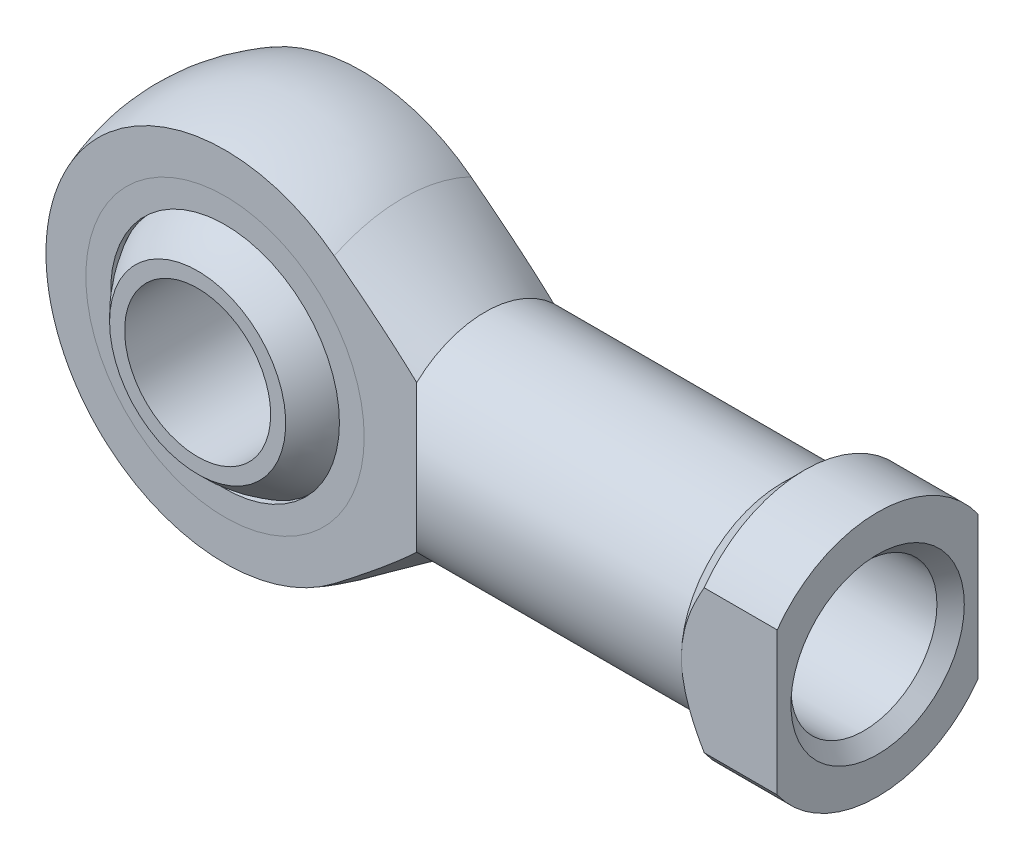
ISO-10303-21;
HEADER;
FILE_DESCRIPTION(('STEP AP214'),'2;1');
FILE_NAME('part.step','',(''),(''),'','','');
FILE_SCHEMA(('AUTOMOTIVE_DESIGN { 1 0 10303 214 1 1 1 1 }'));
ENDSEC;
DATA;
#1=APPLICATION_CONTEXT('core data for automotive mechanical design processes');
#2=APPLICATION_PROTOCOL_DEFINITION('international standard','automotive_design',2000,#1);
#3=PRODUCT_CONTEXT('',#1,'mechanical');
#4=PRODUCT('Part','Part','',(#3));
#5=PRODUCT_RELATED_PRODUCT_CATEGORY('part','',(#4));
#6=PRODUCT_DEFINITION_FORMATION('','',#4);
#7=PRODUCT_DEFINITION_CONTEXT('part definition',#1,'design');
#8=PRODUCT_DEFINITION('design','',#6,#7);
#9=PRODUCT_DEFINITION_SHAPE('','',#8);
#10=(LENGTH_UNIT() NAMED_UNIT(*) SI_UNIT(.MILLI.,.METRE.));
#11=(NAMED_UNIT(*) PLANE_ANGLE_UNIT() SI_UNIT($,.RADIAN.));
#12=(NAMED_UNIT(*) SI_UNIT($,.STERADIAN.) SOLID_ANGLE_UNIT());
#13=UNCERTAINTY_MEASURE_WITH_UNIT(LENGTH_MEASURE(1.E-05),#10,'distance_accuracy_value','');
#14=(GEOMETRIC_REPRESENTATION_CONTEXT(3) GLOBAL_UNCERTAINTY_ASSIGNED_CONTEXT((#13)) GLOBAL_UNIT_ASSIGNED_CONTEXT((#10,
#11,#12)) REPRESENTATION_CONTEXT('',''));
#15=CARTESIAN_POINT('',(0.,0.,0.));
#16=DIRECTION('',(0.,0.,1.));
#17=DIRECTION('',(1.,0.,0.));
#18=AXIS2_PLACEMENT_3D('',#15,#16,#17);
#19=CARTESIAN_POINT('',(0.,0.,0.));
#20=DIRECTION('',(0.,1.,0.));
#21=DIRECTION('',(1.,0.,0.));
#22=AXIS2_PLACEMENT_3D('',#19,#20,#21);
#23=SPHERICAL_SURFACE('',#22,14.26);
#24=CARTESIAN_POINT('',(0.,0.,0.));
#25=DIRECTION('',(0.,0.,-1.));
#26=DIRECTION('',(-1.,0.,0.));
#27=AXIS2_PLACEMENT_3D('',#24,#25,#26);
#28=SPHERICAL_SURFACE('',#27,14.26);
#29=CARTESIAN_POINT('',(0.,0.,10.5));
#30=DIRECTION('',(0.,0.,-1.));
#31=DIRECTION('',(-1.,0.,0.));
#32=AXIS2_PLACEMENT_3D('',#29,#30,#31);
#33=CIRCLE('',#32,9.64870975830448);
#34=CARTESIAN_POINT('',(-9.64870975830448,0.,10.5));
#35=VERTEX_POINT('',#34);
#36=EDGE_CURVE('P0_E26',#35,#35,#33,.F.);
#37=ORIENTED_EDGE('',*,*,#36,.F.);
#38=EDGE_LOOP('',(#37));
#39=FACE_BOUND('',#38,.T.);
#40=CARTESIAN_POINT('',(0.,0.,-10.5));
#41=DIRECTION('',(0.,0.,1.));
#42=DIRECTION('',(1.,0.,0.));
#43=AXIS2_PLACEMENT_3D('',#40,#41,#42);
#44=CIRCLE('',#43,9.64870975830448);
#45=CARTESIAN_POINT('',(9.64870975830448,0.,-10.5));
#46=VERTEX_POINT('',#45);
#47=EDGE_CURVE('P0_E10',#46,#46,#44,.F.);
#48=ORIENTED_EDGE('',*,*,#47,.F.);
#49=EDGE_LOOP('',(#48));
#50=FACE_BOUND('',#49,.T.);
#51=ADVANCED_FACE('P0_F14',(#39,#50),#28,.T.);
#52=CARTESIAN_POINT('',(0.,0.,-14.26));
#53=DIRECTION('',(0.,0.,1.));
#54=DIRECTION('',(1.,0.,0.));
#55=AXIS2_PLACEMENT_3D('',#52,#53,#54);
#56=CYLINDRICAL_SURFACE('',#55,8.);
#57=CARTESIAN_POINT('',(0.,0.,10.5));
#58=DIRECTION('',(0.,0.,-1.));
#59=DIRECTION('',(-1.,0.,0.));
#60=AXIS2_PLACEMENT_3D('',#57,#58,#59);
#61=CIRCLE('',#60,8.);
#62=CARTESIAN_POINT('',(8.,0.,10.5));
#63=VERTEX_POINT('',#62);
#64=EDGE_CURVE('P0_E17',#63,#63,#61,.F.);
#65=CARTESIAN_POINT('',(0.,0.,-10.5));
#66=DIRECTION('',(0.,0.,1.));
#67=DIRECTION('',(1.,0.,0.));
#68=AXIS2_PLACEMENT_3D('',#65,#66,#67);
#69=CIRCLE('',#68,8.);
#70=CARTESIAN_POINT('',(8.,0.,-10.5));
#71=VERTEX_POINT('',#70);
#72=EDGE_CURVE('P0_E21',#71,#71,#69,.F.);
#73=CARTESIAN_POINT('',(8.,0.,10.5));
#74=CARTESIAN_POINT('',(8.,0.,10.28125));
#75=CARTESIAN_POINT('',(8.,0.,10.0625));
#76=CARTESIAN_POINT('',(8.,0.,9.625));
#77=CARTESIAN_POINT('',(8.,0.,9.40625));
#78=CARTESIAN_POINT('',(8.,0.,8.96875));
#79=CARTESIAN_POINT('',(8.,0.,8.75));
#80=CARTESIAN_POINT('',(8.,0.,8.3125));
#81=CARTESIAN_POINT('',(8.,0.,8.09375));
#82=CARTESIAN_POINT('',(8.,0.,7.65625));
#83=CARTESIAN_POINT('',(8.,0.,7.4375));
#84=CARTESIAN_POINT('',(8.,0.,7.));
#85=CARTESIAN_POINT('',(8.,0.,6.78125));
#86=CARTESIAN_POINT('',(8.,0.,6.34375));
#87=CARTESIAN_POINT('',(8.,0.,6.125));
#88=CARTESIAN_POINT('',(8.,0.,5.6875));
#89=CARTESIAN_POINT('',(8.,0.,5.46875));
#90=CARTESIAN_POINT('',(8.,0.,5.03125));
#91=CARTESIAN_POINT('',(8.,0.,4.8125));
#92=CARTESIAN_POINT('',(8.,0.,4.375));
#93=CARTESIAN_POINT('',(8.,0.,4.15625));
#94=CARTESIAN_POINT('',(8.,0.,3.71875));
#95=CARTESIAN_POINT('',(8.,0.,3.5));
#96=CARTESIAN_POINT('',(8.,0.,3.0625));
#97=CARTESIAN_POINT('',(8.,0.,2.84375));
#98=CARTESIAN_POINT('',(8.,0.,2.40625));
#99=CARTESIAN_POINT('',(8.,0.,2.1875));
#100=CARTESIAN_POINT('',(8.,0.,1.75));
#101=CARTESIAN_POINT('',(8.,0.,1.53125));
#102=CARTESIAN_POINT('',(8.,0.,1.09375));
#103=CARTESIAN_POINT('',(8.,0.,0.875000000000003));
#104=CARTESIAN_POINT('',(8.,0.,0.437500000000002));
#105=CARTESIAN_POINT('',(8.,0.,0.218750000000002));
#106=CARTESIAN_POINT('',(8.,0.,-0.218749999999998));
#107=CARTESIAN_POINT('',(8.,0.,-0.437499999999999));
#108=CARTESIAN_POINT('',(8.,0.,-0.874999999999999));
#109=CARTESIAN_POINT('',(8.,0.,-1.09375));
#110=CARTESIAN_POINT('',(8.,0.,-1.53125));
#111=CARTESIAN_POINT('',(8.,0.,-1.75));
#112=CARTESIAN_POINT('',(8.,0.,-2.1875));
#113=CARTESIAN_POINT('',(8.,0.,-2.40625));
#114=CARTESIAN_POINT('',(8.,0.,-2.84375));
#115=CARTESIAN_POINT('',(8.,0.,-3.0625));
#116=CARTESIAN_POINT('',(8.,0.,-3.5));
#117=CARTESIAN_POINT('',(8.,0.,-3.71875));
#118=CARTESIAN_POINT('',(8.,0.,-4.15625));
#119=CARTESIAN_POINT('',(8.,0.,-4.375));
#120=CARTESIAN_POINT('',(8.,0.,-4.8125));
#121=CARTESIAN_POINT('',(8.,0.,-5.03125));
#122=CARTESIAN_POINT('',(8.,0.,-5.46875));
#123=CARTESIAN_POINT('',(8.,0.,-5.6875));
#124=CARTESIAN_POINT('',(8.,0.,-6.125));
#125=CARTESIAN_POINT('',(8.,0.,-6.34375));
#126=CARTESIAN_POINT('',(8.,0.,-6.78125));
#127=CARTESIAN_POINT('',(8.,0.,-7.));
#128=CARTESIAN_POINT('',(8.,0.,-7.4375));
#129=CARTESIAN_POINT('',(8.,0.,-7.65625));
#130=CARTESIAN_POINT('',(8.,0.,-8.09375));
#131=CARTESIAN_POINT('',(8.,0.,-8.3125));
#132=CARTESIAN_POINT('',(8.,0.,-8.75));
#133=CARTESIAN_POINT('',(8.,0.,-8.96875));
#134=CARTESIAN_POINT('',(8.,0.,-9.40625));
#135=CARTESIAN_POINT('',(8.,0.,-9.625));
#136=CARTESIAN_POINT('',(8.,0.,-10.0625));
#137=CARTESIAN_POINT('',(8.,0.,-10.28125));
#138=CARTESIAN_POINT('',(8.,0.,-10.5));
#139=B_SPLINE_CURVE_WITH_KNOTS('',3,(#73,#74,#75,#76,#77,#78,#79,#80,#81,#82,#83,#84,#85,#86,
#87,#88,#89,#90,#91,#92,#93,#94,#95,#96,#97,#98,#99,#100,#101,#102,#103,#104,#105,#106,#107,
#108,#109,#110,#111,#112,#113,#114,#115,#116,#117,#118,#119,#120,#121,#122,#123,#124,#125,#126,
#127,#128,#129,#130,#131,#132,#133,#134,#135,#136,#137,#138),.UNSPECIFIED.,.F.,.F.,(4,2,2,2,2,2,
2,2,2,2,2,2,2,2,2,2,2,2,2,2,2,2,2,2,2,2,2,2,2,2,2,2,4),(0.,0.656250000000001,1.3125,1.96875,
2.625,3.28125,3.9375,4.59375,5.25,5.90625,6.5625,7.21875,7.875,8.53125,9.1875,9.84375,10.5,
11.15625,11.8125,12.46875,13.125,13.78125,14.4375,15.09375,15.75,16.40625,17.0625,17.71875,
18.375,19.03125,19.6875,20.34375,21.),.UNSPECIFIED.);
#140=EDGE_CURVE('P0_BSEAM34',#63,#71,#139,.T.);
#141=ORIENTED_EDGE('',*,*,#64,.T.);
#142=ORIENTED_EDGE('',*,*,#72,.T.);
#143=ORIENTED_EDGE('',*,*,#140,.T.);
#144=ORIENTED_EDGE('',*,*,#140,.F.);
#145=EDGE_LOOP('',(#141,#143,#142,#144));
#146=FACE_BOUND('',#145,.T.);
#147=ADVANCED_FACE('P0_F34',(#146),#56,.F.);
#148=CARTESIAN_POINT('',(-14.26,-14.26,-10.5));
#149=DIRECTION('',(0.,0.,1.));
#150=DIRECTION('',(1.,0.,0.));
#151=AXIS2_PLACEMENT_3D('',#148,#149,#150);
#152=PLANE('',#151);
#153=ORIENTED_EDGE('',*,*,#47,.T.);
#154=EDGE_LOOP('',(#153));
#155=FACE_BOUND('',#154,.T.);
#156=ORIENTED_EDGE('',*,*,#72,.F.);
#157=EDGE_LOOP('',(#156));
#158=FACE_BOUND('',#157,.T.);
#159=ADVANCED_FACE('P0_F39',(#155,#158),#152,.F.);
#160=CARTESIAN_POINT('',(-14.26,-14.26,10.5));
#161=DIRECTION('',(0.,0.,-1.));
#162=DIRECTION('',(-1.,0.,0.));
#163=AXIS2_PLACEMENT_3D('',#160,#161,#162);
#164=PLANE('',#163);
#165=ORIENTED_EDGE('',*,*,#36,.T.);
#166=EDGE_LOOP('',(#165));
#167=FACE_BOUND('',#166,.T.);
#168=ORIENTED_EDGE('',*,*,#64,.F.);
#169=EDGE_LOOP('',(#168));
#170=FACE_BOUND('',#169,.T.);
#171=ADVANCED_FACE('P0_F37',(#167,#170),#164,.F.);
#172=CLOSED_SHELL('',(#51,#147,#159,#171));
#173=MANIFOLD_SOLID_BREP('P0_B1',#172);
#174=CARTESIAN_POINT('',(0.,0.,7.5));
#175=DIRECTION('',(0.,0.,1.));
#176=DIRECTION('',(1.,0.,0.));
#177=AXIS2_PLACEMENT_3D('',#174,#175,#176);
#178=PLANE('',#177);
#179=CARTESIAN_POINT('',(0.,0.,7.5));
#180=DIRECTION('',(0.,0.,1.));
#181=DIRECTION('',(1.,0.,0.));
#182=AXIS2_PLACEMENT_3D('',#179,#180,#181);
#183=CIRCLE('',#182,15.25);
#184=CARTESIAN_POINT('',(15.25,0.,7.5));
#185=VERTEX_POINT('',#184);
#186=EDGE_CURVE('P1_E10',#185,#185,#183,.T.);
#187=ORIENTED_EDGE('',*,*,#186,.T.);
#188=EDGE_LOOP('',(#187));
#189=FACE_BOUND('',#188,.T.);
#190=CARTESIAN_POINT('',(0.,0.,7.5));
#191=DIRECTION('',(0.,0.,1.));
#192=DIRECTION('',(1.,0.,0.));
#193=AXIS2_PLACEMENT_3D('',#190,#191,#192);
#194=CIRCLE('',#193,12.535);
#195=CARTESIAN_POINT('',(12.535,0.,7.5));
#196=VERTEX_POINT('',#195);
#197=EDGE_CURVE('P1_E25',#196,#196,#194,.T.);
#198=ORIENTED_EDGE('',*,*,#197,.F.);
#199=EDGE_LOOP('',(#198));
#200=FACE_BOUND('',#199,.T.);
#201=ADVANCED_FACE('P1_F14',(#189,#200),#178,.T.);
#202=CARTESIAN_POINT('',(0.,0.,6.8));
#203=DIRECTION('',(0.,0.,1.));
#204=DIRECTION('',(1.,0.,0.));
#205=AXIS2_PLACEMENT_3D('',#202,#203,#204);
#206=PLANE('',#205);
#207=CARTESIAN_POINT('',(0.,0.,6.8));
#208=DIRECTION('',(0.,0.,1.));
#209=DIRECTION('',(1.,0.,0.));
#210=AXIS2_PLACEMENT_3D('',#207,#208,#209);
#211=CIRCLE('',#210,15.25);
#212=CARTESIAN_POINT('',(15.25,0.,6.8));
#213=VERTEX_POINT('',#212);
#214=EDGE_CURVE('P1_E18',#213,#213,#211,.T.);
#215=ORIENTED_EDGE('',*,*,#214,.F.);
#216=EDGE_LOOP('',(#215));
#217=FACE_BOUND('',#216,.T.);
#218=CARTESIAN_POINT('',(0.,0.,6.8));
#219=DIRECTION('',(0.,0.,1.));
#220=DIRECTION('',(1.,0.,0.));
#221=AXIS2_PLACEMENT_3D('',#218,#219,#220);
#222=CIRCLE('',#221,12.535);
#223=CARTESIAN_POINT('',(12.535,0.,6.8));
#224=VERTEX_POINT('',#223);
#225=EDGE_CURVE('P1_E27',#224,#224,#222,.T.);
#226=ORIENTED_EDGE('',*,*,#225,.T.);
#227=EDGE_LOOP('',(#226));
#228=FACE_BOUND('',#227,.T.);
#229=ADVANCED_FACE('P1_F37',(#217,#228),#206,.F.);
#230=CARTESIAN_POINT('',(0.,0.,7.5));
#231=DIRECTION('',(0.,0.,-1.));
#232=DIRECTION('',(-1.,0.,0.));
#233=AXIS2_PLACEMENT_3D('',#230,#231,#232);
#234=CYLINDRICAL_SURFACE('',#233,15.25);
#235=ORIENTED_EDGE('',*,*,#186,.F.);
#236=EDGE_LOOP('',(#235));
#237=FACE_BOUND('',#236,.T.);
#238=ORIENTED_EDGE('',*,*,#214,.T.);
#239=EDGE_LOOP('',(#238));
#240=FACE_BOUND('',#239,.T.);
#241=ADVANCED_FACE('P1_F16',(#237,#240),#234,.T.);
#242=CARTESIAN_POINT('',(0.,0.,7.5));
#243=DIRECTION('',(0.,0.,-1.));
#244=DIRECTION('',(-1.,0.,0.));
#245=AXIS2_PLACEMENT_3D('',#242,#243,#244);
#246=CYLINDRICAL_SURFACE('',#245,12.535);
#247=ORIENTED_EDGE('',*,*,#197,.T.);
#248=EDGE_LOOP('',(#247));
#249=FACE_BOUND('',#248,.T.);
#250=ORIENTED_EDGE('',*,*,#225,.F.);
#251=EDGE_LOOP('',(#250));
#252=FACE_BOUND('',#251,.T.);
#253=ADVANCED_FACE('P1_F33',(#249,#252),#246,.F.);
#254=CLOSED_SHELL('',(#201,#229,#241,#253));
#255=MANIFOLD_SOLID_BREP('P1_B1',#254);
#256=CARTESIAN_POINT('',(0.,0.,-6.8));
#257=DIRECTION('',(0.,0.,1.));
#258=DIRECTION('',(1.,0.,0.));
#259=AXIS2_PLACEMENT_3D('',#256,#257,#258);
#260=PLANE('',#259);
#261=CARTESIAN_POINT('',(0.,0.,-6.8));
#262=DIRECTION('',(0.,0.,1.));
#263=DIRECTION('',(1.,0.,0.));
#264=AXIS2_PLACEMENT_3D('',#261,#262,#263);
#265=CIRCLE('',#264,15.25);
#266=CARTESIAN_POINT('',(15.25,0.,-6.8));
#267=VERTEX_POINT('',#266);
#268=EDGE_CURVE('P2_E10',#267,#267,#265,.T.);
#269=ORIENTED_EDGE('',*,*,#268,.T.);
#270=EDGE_LOOP('',(#269));
#271=FACE_BOUND('',#270,.T.);
#272=CARTESIAN_POINT('',(0.,0.,-6.8));
#273=DIRECTION('',(0.,0.,1.));
#274=DIRECTION('',(1.,0.,0.));
#275=AXIS2_PLACEMENT_3D('',#272,#273,#274);
#276=CIRCLE('',#275,12.535);
#277=CARTESIAN_POINT('',(12.535,0.,-6.8));
#278=VERTEX_POINT('',#277);
#279=EDGE_CURVE('P2_E25',#278,#278,#276,.T.);
#280=ORIENTED_EDGE('',*,*,#279,.F.);
#281=EDGE_LOOP('',(#280));
#282=FACE_BOUND('',#281,.T.);
#283=ADVANCED_FACE('P2_F14',(#271,#282),#260,.T.);
#284=CARTESIAN_POINT('',(0.,0.,-7.5));
#285=DIRECTION('',(0.,0.,1.));
#286=DIRECTION('',(1.,0.,0.));
#287=AXIS2_PLACEMENT_3D('',#284,#285,#286);
#288=PLANE('',#287);
#289=CARTESIAN_POINT('',(0.,0.,-7.5));
#290=DIRECTION('',(0.,0.,1.));
#291=DIRECTION('',(1.,0.,0.));
#292=AXIS2_PLACEMENT_3D('',#289,#290,#291);
#293=CIRCLE('',#292,15.25);
#294=CARTESIAN_POINT('',(15.25,0.,-7.5));
#295=VERTEX_POINT('',#294);
#296=EDGE_CURVE('P2_E18',#295,#295,#293,.T.);
#297=ORIENTED_EDGE('',*,*,#296,.F.);
#298=EDGE_LOOP('',(#297));
#299=FACE_BOUND('',#298,.T.);
#300=CARTESIAN_POINT('',(0.,0.,-7.5));
#301=DIRECTION('',(0.,0.,1.));
#302=DIRECTION('',(1.,0.,0.));
#303=AXIS2_PLACEMENT_3D('',#300,#301,#302);
#304=CIRCLE('',#303,12.535);
#305=CARTESIAN_POINT('',(12.535,0.,-7.5));
#306=VERTEX_POINT('',#305);
#307=EDGE_CURVE('P2_E27',#306,#306,#304,.T.);
#308=ORIENTED_EDGE('',*,*,#307,.T.);
#309=EDGE_LOOP('',(#308));
#310=FACE_BOUND('',#309,.T.);
#311=ADVANCED_FACE('P2_F37',(#299,#310),#288,.F.);
#312=CARTESIAN_POINT('',(0.,0.,-6.8));
#313=DIRECTION('',(0.,0.,-1.));
#314=DIRECTION('',(-1.,0.,0.));
#315=AXIS2_PLACEMENT_3D('',#312,#313,#314);
#316=CYLINDRICAL_SURFACE('',#315,15.25);
#317=ORIENTED_EDGE('',*,*,#268,.F.);
#318=EDGE_LOOP('',(#317));
#319=FACE_BOUND('',#318,.T.);
#320=ORIENTED_EDGE('',*,*,#296,.T.);
#321=EDGE_LOOP('',(#320));
#322=FACE_BOUND('',#321,.T.);
#323=ADVANCED_FACE('P2_F16',(#319,#322),#316,.T.);
#324=CARTESIAN_POINT('',(0.,0.,-6.8));
#325=DIRECTION('',(0.,0.,-1.));
#326=DIRECTION('',(-1.,0.,0.));
#327=AXIS2_PLACEMENT_3D('',#324,#325,#326);
#328=CYLINDRICAL_SURFACE('',#327,12.535);
#329=ORIENTED_EDGE('',*,*,#279,.T.);
#330=EDGE_LOOP('',(#329));
#331=FACE_BOUND('',#330,.T.);
#332=ORIENTED_EDGE('',*,*,#307,.F.);
#333=EDGE_LOOP('',(#332));
#334=FACE_BOUND('',#333,.T.);
#335=ADVANCED_FACE('P2_F33',(#331,#334),#328,.F.);
#336=CLOSED_SHELL('',(#283,#311,#323,#335));
#337=MANIFOLD_SOLID_BREP('P2_B1',#336);
#338=CARTESIAN_POINT('',(0.,0.,0.));
#339=DIRECTION('',(0.,1.,0.));
#340=DIRECTION('',(1.,0.,0.));
#341=AXIS2_PLACEMENT_3D('',#338,#339,#340);
#342=SPHERICAL_SURFACE('',#341,14.26);
#343=CARTESIAN_POINT('',(0.,0.,0.));
#344=DIRECTION('',(0.,0.,1.));
#345=DIRECTION('',(1.,0.,0.));
#346=AXIS2_PLACEMENT_3D('',#343,#344,#345);
#347=SPHERICAL_SURFACE('',#346,14.26);
#348=CARTESIAN_POINT('',(0.,0.,6.8));
#349=DIRECTION('',(0.,0.,1.));
#350=DIRECTION('',(1.,0.,0.));
#351=AXIS2_PLACEMENT_3D('',#348,#349,#350);
#352=CIRCLE('',#351,12.5342570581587);
#353=CARTESIAN_POINT('',(12.5342570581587,0.,6.8));
#354=VERTEX_POINT('',#353);
#355=EDGE_CURVE('P3_E73',#354,#354,#352,.F.);
#356=ORIENTED_EDGE('',*,*,#355,.F.);
#357=EDGE_LOOP('',(#356));
#358=FACE_BOUND('',#357,.T.);
#359=CARTESIAN_POINT('',(0.,0.,-6.8));
#360=DIRECTION('',(0.,0.,-1.));
#361=DIRECTION('',(-1.,0.,0.));
#362=AXIS2_PLACEMENT_3D('',#359,#360,#361);
#363=CIRCLE('',#362,12.5342570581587);
#364=CARTESIAN_POINT('',(-12.5342570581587,0.,-6.8));
#365=VERTEX_POINT('',#364);
#366=EDGE_CURVE('P3_E20',#365,#365,#363,.F.);
#367=ORIENTED_EDGE('',*,*,#366,.F.);
#368=EDGE_LOOP('',(#367));
#369=FACE_BOUND('',#368,.T.);
#370=ADVANCED_FACE('P3_F16',(#358,#369),#347,.F.);
#371=CARTESIAN_POINT('',(-21.,-21.,-7.5));
#372=DIRECTION('',(0.,0.,1.));
#373=DIRECTION('',(1.,0.,0.));
#374=AXIS2_PLACEMENT_3D('',#371,#372,#373);
#375=PLANE('',#374);
#376=CARTESIAN_POINT('',(0.,0.,-7.5));
#377=DIRECTION('',(0.,0.,1.));
#378=DIRECTION('',(1.,0.,0.));
#379=AXIS2_PLACEMENT_3D('',#376,#377,#378);
#380=CIRCLE('',#379,19.615045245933);
#381=CARTESIAN_POINT('',(11.9572953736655,15.5490542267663,-7.5));
#382=VERTEX_POINT('',#381);
#383=CARTESIAN_POINT('',(11.9572953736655,-15.5490542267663,-7.5));
#384=VERTEX_POINT('',#383);
#385=EDGE_CURVE('P3_E11',#382,#384,#380,.T.);
#386=ORIENTED_EDGE('',*,*,#385,.F.);
#387=CARTESIAN_POINT('',(-20.4186494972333,-38.9731517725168,-7.5));
#388=CARTESIAN_POINT('',(-19.5750747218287,-38.378133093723,-7.5));
#389=CARTESIAN_POINT('',(-18.7317254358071,-37.7827946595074,-7.5));
#390=CARTESIAN_POINT('',(-17.0455548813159,-36.5913693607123,-7.5));
#391=CARTESIAN_POINT('',(-16.2027336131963,-35.9952824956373,-7.5));
#392=CARTESIAN_POINT('',(-13.6749211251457,-34.2055544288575,-7.5));
#393=CARTESIAN_POINT('',(-11.9908395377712,-33.0106278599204,-7.5));
#394=CARTESIAN_POINT('',(-8.6185109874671,-30.6107970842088,-7.5));
#395=CARTESIAN_POINT('',(-6.93027877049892,-29.4058721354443,-7.5));
#396=CARTESIAN_POINT('',(-4.40165670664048,-27.5935380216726,-7.5));
#397=CARTESIAN_POINT('',(-3.55946338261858,-26.9886453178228,-7.5));
#398=CARTESIAN_POINT('',(-1.87655392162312,-25.7768116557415,-7.5));
#399=CARTESIAN_POINT('',(-1.03583778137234,-25.1698707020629,-7.5));
#400=CARTESIAN_POINT('',(0.674933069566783,-23.9309099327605,-7.5));
#401=CARTESIAN_POINT('',(1.54491901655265,-23.2987951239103,-7.5));
#402=CARTESIAN_POINT('',(3.28240883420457,-22.031163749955,-7.5));
#403=CARTESIAN_POINT('',(4.14991270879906,-21.3956471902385,-7.5));
#404=CARTESIAN_POINT('',(5.88209756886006,-20.1199564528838,-7.5));
#405=CARTESIAN_POINT('',(6.74677709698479,-19.4797802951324,-7.5));
#406=CARTESIAN_POINT('',(8.47184385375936,-18.1937142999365,-7.5));
#407=CARTESIAN_POINT('',(9.33223121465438,-17.5478246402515,-7.5));
#408=CARTESIAN_POINT('',(10.6173450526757,-16.5739546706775,-7.5));
#409=CARTESIAN_POINT('',(11.0442843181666,-16.248894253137,-7.5));
#410=CARTESIAN_POINT('',(11.8964090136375,-15.5964837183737,-7.5));
#411=CARTESIAN_POINT('',(12.3215944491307,-15.2691336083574,-7.5));
#412=CARTESIAN_POINT('',(13.1699183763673,-14.6116703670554,-7.5));
#413=CARTESIAN_POINT('',(13.5930565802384,-14.2815568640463,-7.5));
#414=CARTESIAN_POINT('',(14.43676436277,-13.6180650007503,-7.5));
#415=CARTESIAN_POINT('',(14.8573339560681,-13.2846866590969,-7.5));
#416=CARTESIAN_POINT('',(15.6949741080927,-12.6142179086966,-7.5));
#417=CARTESIAN_POINT('',(16.112047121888,-12.2771305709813,-7.5));
#418=CARTESIAN_POINT('',(16.9422147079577,-11.5980593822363,-7.5));
#419=CARTESIAN_POINT('',(17.3553091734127,-11.256075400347,-7.5));
#420=CARTESIAN_POINT('',(18.1762624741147,-10.5660719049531,-7.5));
#421=CARTESIAN_POINT('',(18.5841225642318,-10.2180538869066,-7.5));
#422=CARTESIAN_POINT('',(19.3930686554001,-9.51424690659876,-7.5));
#423=CARTESIAN_POINT('',(19.7941551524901,-9.1584585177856,-7.5));
#424=CARTESIAN_POINT('',(20.3321704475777,-8.66875648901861,-7.5));
#425=CARTESIAN_POINT('',(20.473133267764,-8.53926890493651,-7.5));
#426=CARTESIAN_POINT('',(20.7537279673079,-8.27884907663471,-7.5));
#427=CARTESIAN_POINT('',(20.8933598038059,-8.14791678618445,-7.5));
#428=CARTESIAN_POINT('',(21.1711298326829,-7.88444413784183,-7.5));
#429=CARTESIAN_POINT('',(21.3092678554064,-7.75190360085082,-7.5));
#430=CARTESIAN_POINT('',(21.5838188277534,-7.48505053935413,-7.5));
#431=CARTESIAN_POINT('',(21.7202317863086,-7.35073802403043,-7.5));
#432=CARTESIAN_POINT('',(22.127207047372,-6.94416414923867,-7.5));
#433=CARTESIAN_POINT('',(22.3948117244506,-6.66892057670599,-7.5));
#434=CARTESIAN_POINT('',(22.919456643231,-6.10853973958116,-7.5));
#435=CARTESIAN_POINT('',(23.1764983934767,-5.82340389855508,-7.5));
#436=CARTESIAN_POINT('',(23.6282949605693,-5.29620884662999,-7.5));
#437=CARTESIAN_POINT('',(23.8255709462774,-5.05632128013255,-7.5));
#438=CARTESIAN_POINT('',(24.2074811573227,-4.5664330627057,-7.5));
#439=CARTESIAN_POINT('',(24.3921103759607,-4.3164284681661,-7.5));
#440=CARTESIAN_POINT('',(24.7434432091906,-3.80530647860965,-7.5));
#441=CARTESIAN_POINT('',(24.9102077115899,-3.5442313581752,-7.5));
#442=CARTESIAN_POINT('',(25.2199020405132,-3.00833649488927,-7.5));
#443=CARTESIAN_POINT('',(25.3628586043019,-2.73353262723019,-7.5));
#444=CARTESIAN_POINT('',(25.5586936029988,-2.29689867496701,-7.5));
#445=CARTESIAN_POINT('',(25.6230615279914,-2.14021442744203,-7.5));
#446=CARTESIAN_POINT('',(25.7401869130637,-1.82259274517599,-7.5));
#447=CARTESIAN_POINT('',(25.7929496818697,-1.66165729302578,-7.5));
#448=CARTESIAN_POINT('',(25.8849560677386,-1.33645614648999,-7.5));
#449=CARTESIAN_POINT('',(25.9242396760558,-1.17220186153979,-7.5));
#450=CARTESIAN_POINT('',(25.987854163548,-0.840880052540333,-7.5));
#451=CARTESIAN_POINT('',(26.0121958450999,-0.673814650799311,-7.5));
#452=CARTESIAN_POINT('',(26.0366804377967,-0.421947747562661,-7.5));
#453=CARTESIAN_POINT('',(26.0428374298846,-0.337698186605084,-7.5));
#454=CARTESIAN_POINT('',(26.0510617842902,-0.16897023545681,-7.5));
#455=CARTESIAN_POINT('',(26.0531277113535,-0.0844917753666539,-7.5));
#456=CARTESIAN_POINT('',(26.0531196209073,0.167624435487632,-7.5));
#457=CARTESIAN_POINT('',(26.0449722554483,0.335301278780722,-7.5));
#458=CARTESIAN_POINT('',(26.0127743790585,0.669184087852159,-7.5));
#459=CARTESIAN_POINT('',(25.9887132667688,0.835388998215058,-7.5));
#460=CARTESIAN_POINT('',(25.9257527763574,1.16530265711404,-7.5));
#461=CARTESIAN_POINT('',(25.8868221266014,1.32900538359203,-7.5));
#462=CARTESIAN_POINT('',(25.7957333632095,1.65263263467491,-7.5));
#463=CARTESIAN_POINT('',(25.7435753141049,1.81255717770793,-7.5));
#464=CARTESIAN_POINT('',(25.5987934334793,2.20722485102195,-7.5));
#465=CARTESIAN_POINT('',(25.4989850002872,2.43933237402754,-7.5));
#466=CARTESIAN_POINT('',(25.2792082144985,2.89378482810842,-7.5));
#467=CARTESIAN_POINT('',(25.1592250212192,3.11612241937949,-7.5));
#468=CARTESIAN_POINT('',(24.9032648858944,3.55258374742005,-7.5));
#469=CARTESIAN_POINT('',(24.7672220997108,3.76666853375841,-7.5));
#470=CARTESIAN_POINT('',(24.5542183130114,4.08160434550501,-7.5));
#471=CARTESIAN_POINT('',(24.481737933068,4.1855368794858,-7.5));
#472=CARTESIAN_POINT('',(24.3341301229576,4.39150531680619,-7.5));
#473=CARTESIAN_POINT('',(24.2590027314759,4.49354124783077,-7.5));
#474=CARTESIAN_POINT('',(24.0404356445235,4.78334616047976,-7.5));
#475=CARTESIAN_POINT('',(23.8941097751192,4.96894050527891,-7.5));
#476=CARTESIAN_POINT('',(23.5949858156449,5.33485784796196,-7.5));
#477=CARTESIAN_POINT('',(23.4421865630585,5.51517988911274,-7.5));
#478=CARTESIAN_POINT('',(23.131266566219,5.87135922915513,-7.5));
#479=CARTESIAN_POINT('',(22.9731425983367,6.04721370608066,-7.5));
#480=CARTESIAN_POINT('',(22.6525991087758,6.39497319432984,-7.5));
#481=CARTESIAN_POINT('',(22.4901792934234,6.56687793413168,-7.5));
#482=CARTESIAN_POINT('',(22.161375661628,6.90768007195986,-7.5));
#483=CARTESIAN_POINT('',(21.9949829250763,7.07656884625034,-7.5));
#484=CARTESIAN_POINT('',(21.6591990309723,7.41134291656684,-7.5));
#485=CARTESIAN_POINT('',(21.4898077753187,7.5772281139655,-7.5));
#486=CARTESIAN_POINT('',(20.9779803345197,8.07083418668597,-7.5));
#487=CARTESIAN_POINT('',(20.6317630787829,8.3946361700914,-7.5));
#488=CARTESIAN_POINT('',(19.928774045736,9.03704234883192,-7.5));
#489=CARTESIAN_POINT('',(19.5719348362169,9.35557228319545,-7.5));
#490=CARTESIAN_POINT('',(18.8525338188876,9.98614212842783,-7.5));
#491=CARTESIAN_POINT('',(18.4899715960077,10.2981815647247,-7.5));
#492=CARTESIAN_POINT('',(17.7610397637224,10.9165177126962,-7.5));
#493=CARTESIAN_POINT('',(17.3946775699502,11.2228231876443,-7.5));
#494=CARTESIAN_POINT('',(16.6584682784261,11.8311855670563,-7.5));
#495=CARTESIAN_POINT('',(16.2886212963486,12.1332426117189,-7.5));
#496=CARTESIAN_POINT('',(15.5403940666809,12.7384805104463,-7.5));
#497=CARTESIAN_POINT('',(15.1619700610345,13.041607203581,-7.5));
#498=CARTESIAN_POINT('',(14.4027354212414,13.6448587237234,-7.5));
#499=CARTESIAN_POINT('',(14.0219247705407,13.9449835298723,-7.5));
#500=CARTESIAN_POINT('',(12.8765238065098,14.8416113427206,-7.5));
#501=CARTESIAN_POINT('',(12.1089867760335,15.4343498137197,-7.5));
#502=CARTESIAN_POINT('',(10.5682621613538,16.6126141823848,-7.5));
#503=CARTESIAN_POINT('',(9.79507388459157,17.1981391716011,-7.5));
#504=CARTESIAN_POINT('',(8.24457097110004,18.3637056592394,-7.5));
#505=CARTESIAN_POINT('',(7.46725630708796,18.9437471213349,-7.5));
#506=CARTESIAN_POINT('',(5.90856712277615,20.1002897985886,-7.5));
#507=CARTESIAN_POINT('',(5.127188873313,20.6767859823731,-7.5));
#508=CARTESIAN_POINT('',(3.56198046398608,21.8264440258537,-7.5));
#509=CARTESIAN_POINT('',(2.77815029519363,22.3996058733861,-7.5));
#510=CARTESIAN_POINT('',(1.20860414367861,23.5432126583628,-7.5));
#511=CARTESIAN_POINT('',(0.422888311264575,24.1136578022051,-7.5));
#512=CARTESIAN_POINT('',(-1.15011979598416,25.2523703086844,-7.5));
#513=CARTESIAN_POINT('',(-1.93741207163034,25.8206376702,-7.5));
#514=CARTESIAN_POINT('',(-4.19489882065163,27.4462053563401,-7.5));
#515=CARTESIAN_POINT('',(-5.66668586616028,28.5012938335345,-7.5));
#516=CARTESIAN_POINT('',(-8.61347277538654,30.6070435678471,-7.5));
#517=CARTESIAN_POINT('',(-10.0884727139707,31.6577047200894,-7.5));
#518=CARTESIAN_POINT('',(-13.0383470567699,33.7539383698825,-7.5));
#519=CARTESIAN_POINT('',(-14.51321748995,34.7995164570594,-7.5));
#520=CARTESIAN_POINT('',(-16.7268472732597,36.3659680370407,-7.5));
#521=CARTESIAN_POINT('',(-17.4649343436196,36.8877921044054,-7.5));
#522=CARTESIAN_POINT('',(-18.9415061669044,37.9308768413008,-7.5));
#523=CARTESIAN_POINT('',(-19.6799909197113,38.4521375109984,-7.5));
#524=CARTESIAN_POINT('',(-20.4186494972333,38.9731517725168,-7.5));
#525=B_SPLINE_CURVE_WITH_KNOTS('',3,(#387,#388,#389,#390,#391,#392,#393,#394,#395,#396,#397,
#398,#399,#400,#401,#402,#403,#404,#405,#406,#407,#408,#409,#410,#411,#412,#413,#414,#415,#416,
#417,#418,#419,#420,#421,#422,#423,#424,#425,#426,#427,#428,#429,#430,#431,#432,#433,#434,#435,
#436,#437,#438,#439,#440,#441,#442,#443,#444,#445,#446,#447,#448,#449,#450,#451,#452,#453,#454,
#455,#456,#457,#458,#459,#460,#461,#462,#463,#464,#465,#466,#467,#468,#469,#470,#471,#472,#473,
#474,#475,#476,#477,#478,#479,#480,#481,#482,#483,#484,#485,#486,#487,#488,#489,#490,#491,#492,
#493,#494,#495,#496,#497,#498,#499,#500,#501,#502,#503,#504,#505,#506,#507,#508,#509,#510,#511,
#512,#513,#514,#515,#516,#517,#518,#519,#520,#521,#522,#523,#524),.UNSPECIFIED.,.F.,.F.,(4,2,2,
2,2,2,2,2,2,2,2,2,2,2,2,2,2,2,2,2,2,2,2,2,2,2,2,2,2,2,2,2,2,2,2,2,2,2,2,2,2,2,2,2,2,2,2,2,2,2,2,
2,2,2,2,2,2,2,2,2,2,2,2,2,2,2,2,2,4),(0.,3.09693240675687,6.19386686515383,12.388683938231,
18.6110294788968,21.7217606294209,24.8324848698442,28.0586221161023,31.2847542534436,
34.5123483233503,37.7398423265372,39.3496414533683,40.9594355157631,42.5694497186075,
44.1794547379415,45.7882143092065,47.3970169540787,49.0054264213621,50.6137175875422,
51.1879378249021,51.7621764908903,52.3364797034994,52.9107799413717,54.0622405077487,
55.213536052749,56.1449824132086,57.0767954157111,58.0053241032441,58.9328028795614,
59.4406066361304,59.9481776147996,60.4542293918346,60.9599148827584,61.2132502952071,
61.4666745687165,61.9694465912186,62.4725538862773,62.9767251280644,63.4808939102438,
64.2375242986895,64.9947137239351,65.7551231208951,66.1352209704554,66.5153132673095,
67.2241346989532,67.9330839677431,68.6424704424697,69.3519055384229,70.0631199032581,
70.7743575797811,72.1962857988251,73.6311724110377,75.0661635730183,76.4987451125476,
77.9312792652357,79.3858449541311,80.840420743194,83.7496581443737,86.6592582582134,
89.5688776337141,92.4819577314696,95.3950484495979,98.3079142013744,101.220781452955,
106.653476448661,112.08629942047,117.509974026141,120.2217363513,122.933497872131),.UNSPECIFIED.);
#526=CARTESIAN_POINT('',(21.,8.04673846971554,-7.5));
#527=VERTEX_POINT('',#526);
#528=EDGE_CURVE('P3_E102',#527,#382,#525,.T.);
#529=ORIENTED_EDGE('',*,*,#528,.F.);
#530=DIRECTION('',(0.,1.,0.));
#531=VECTOR('',#530,1.);
#532=CARTESIAN_POINT('',(21.,-21.,-7.5));
#533=LINE('',#532,#531);
#534=CARTESIAN_POINT('',(21.,-8.04673846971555,-7.5));
#535=VERTEX_POINT('',#534);
#536=EDGE_CURVE('P3_E64',#535,#527,#533,.T.);
#537=ORIENTED_EDGE('',*,*,#536,.F.);
#538=EDGE_CURVE('P3_E33',#384,#535,#525,.T.);
#539=ORIENTED_EDGE('',*,*,#538,.F.);
#540=EDGE_LOOP('',(#386,#529,#537,#539));
#541=FACE_BOUND('',#540,.T.);
#542=CARTESIAN_POINT('',(0.,0.,-7.5));
#543=DIRECTION('',(0.,0.,1.));
#544=DIRECTION('',(1.,0.,0.));
#545=AXIS2_PLACEMENT_3D('',#542,#543,#544);
#546=CIRCLE('',#545,15.25);
#547=CARTESIAN_POINT('',(15.25,0.,-7.5));
#548=VERTEX_POINT('',#547);
#549=EDGE_CURVE('P3_E95',#548,#548,#546,.T.);
#550=ORIENTED_EDGE('',*,*,#549,.T.);
#551=EDGE_LOOP('',(#550));
#552=FACE_BOUND('',#551,.T.);
#553=ADVANCED_FACE('P3_F115',(#541,#552),#375,.F.);
#554=CARTESIAN_POINT('',(21.,0.,0.));
#555=DIRECTION('',(-1.,0.,0.));
#556=DIRECTION('',(0.,0.,1.));
#557=AXIS2_PLACEMENT_3D('',#554,#555,#556);
#558=CONICAL_SURFACE('',#557,11.,0.605769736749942);
#559=CARTESIAN_POINT('',(11.9572953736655,0.,0.));
#560=DIRECTION('',(-1.,0.,0.));
#561=DIRECTION('',(0.,0.,1.));
#562=AXIS2_PLACEMENT_3D('',#559,#560,#561);
#563=CIRCLE('',#562,17.2633451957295);
#564=CARTESIAN_POINT('',(11.9572953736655,-15.5490542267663,7.5));
#565=VERTEX_POINT('',#564);
#566=EDGE_CURVE('P3_E79',#384,#565,#563,.T.);
#567=ORIENTED_EDGE('',*,*,#566,.F.);
#568=ORIENTED_EDGE('',*,*,#538,.T.);
#569=CARTESIAN_POINT('',(21.,0.,0.));
#570=DIRECTION('',(-1.,0.,0.));
#571=DIRECTION('',(0.,0.,1.));
#572=AXIS2_PLACEMENT_3D('',#569,#570,#571);
#573=CIRCLE('',#572,11.);
#574=CARTESIAN_POINT('',(21.,-8.04673846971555,7.5));
#575=VERTEX_POINT('',#574);
#576=EDGE_CURVE('P3_E70',#535,#575,#573,.T.);
#577=ORIENTED_EDGE('',*,*,#576,.T.);
#578=CARTESIAN_POINT('',(-20.4186494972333,38.9731517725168,7.5));
#579=CARTESIAN_POINT('',(-19.5750747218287,38.378133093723,7.5));
#580=CARTESIAN_POINT('',(-18.7317254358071,37.7827946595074,7.5));
#581=CARTESIAN_POINT('',(-17.0455548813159,36.5913693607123,7.5));
#582=CARTESIAN_POINT('',(-16.2027336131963,35.9952824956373,7.5));
#583=CARTESIAN_POINT('',(-13.6749211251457,34.2055544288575,7.5));
#584=CARTESIAN_POINT('',(-11.9908395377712,33.0106278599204,7.5));
#585=CARTESIAN_POINT('',(-8.6185109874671,30.6107970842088,7.5));
#586=CARTESIAN_POINT('',(-6.93027877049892,29.4058721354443,7.5));
#587=CARTESIAN_POINT('',(-4.40165670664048,27.5935380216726,7.5));
#588=CARTESIAN_POINT('',(-3.55946338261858,26.9886453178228,7.5));
#589=CARTESIAN_POINT('',(-1.87655392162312,25.7768116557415,7.5));
#590=CARTESIAN_POINT('',(-1.03583778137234,25.1698707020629,7.5));
#591=CARTESIAN_POINT('',(0.674933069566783,23.9309099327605,7.5));
#592=CARTESIAN_POINT('',(1.54491901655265,23.2987951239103,7.5));
#593=CARTESIAN_POINT('',(3.28240883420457,22.031163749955,7.5));
#594=CARTESIAN_POINT('',(4.14991270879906,21.3956471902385,7.5));
#595=CARTESIAN_POINT('',(5.88209756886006,20.1199564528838,7.5));
#596=CARTESIAN_POINT('',(6.74677709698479,19.4797802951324,7.5));
#597=CARTESIAN_POINT('',(8.47184385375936,18.1937142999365,7.5));
#598=CARTESIAN_POINT('',(9.33223121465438,17.5478246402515,7.5));
#599=CARTESIAN_POINT('',(10.6173450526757,16.5739546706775,7.5));
#600=CARTESIAN_POINT('',(11.0442843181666,16.248894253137,7.5));
#601=CARTESIAN_POINT('',(11.8964090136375,15.5964837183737,7.5));
#602=CARTESIAN_POINT('',(12.3215944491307,15.2691336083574,7.5));
#603=CARTESIAN_POINT('',(13.1699183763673,14.6116703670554,7.5));
#604=CARTESIAN_POINT('',(13.5930565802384,14.2815568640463,7.5));
#605=CARTESIAN_POINT('',(14.43676436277,13.6180650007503,7.5));
#606=CARTESIAN_POINT('',(14.8573339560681,13.2846866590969,7.5));
#607=CARTESIAN_POINT('',(15.6949741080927,12.6142179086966,7.5));
#608=CARTESIAN_POINT('',(16.112047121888,12.2771305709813,7.5));
#609=CARTESIAN_POINT('',(16.9422147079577,11.5980593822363,7.5));
#610=CARTESIAN_POINT('',(17.3553091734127,11.256075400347,7.5));
#611=CARTESIAN_POINT('',(18.1762624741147,10.5660719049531,7.5));
#612=CARTESIAN_POINT('',(18.5841225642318,10.2180538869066,7.5));
#613=CARTESIAN_POINT('',(19.3930686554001,9.51424690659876,7.5));
#614=CARTESIAN_POINT('',(19.7941551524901,9.1584585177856,7.5));
#615=CARTESIAN_POINT('',(20.3321704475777,8.66875648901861,7.5));
#616=CARTESIAN_POINT('',(20.473133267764,8.53926890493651,7.5));
#617=CARTESIAN_POINT('',(20.7537279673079,8.27884907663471,7.5));
#618=CARTESIAN_POINT('',(20.8933598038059,8.14791678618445,7.5));
#619=CARTESIAN_POINT('',(21.1711298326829,7.88444413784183,7.5));
#620=CARTESIAN_POINT('',(21.3092678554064,7.75190360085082,7.5));
#621=CARTESIAN_POINT('',(21.5838188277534,7.48505053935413,7.5));
#622=CARTESIAN_POINT('',(21.7202317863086,7.35073802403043,7.5));
#623=CARTESIAN_POINT('',(22.127207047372,6.94416414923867,7.5));
#624=CARTESIAN_POINT('',(22.3948117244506,6.66892057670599,7.5));
#625=CARTESIAN_POINT('',(22.919456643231,6.10853973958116,7.5));
#626=CARTESIAN_POINT('',(23.1764983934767,5.82340389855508,7.5));
#627=CARTESIAN_POINT('',(23.6282949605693,5.29620884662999,7.5));
#628=CARTESIAN_POINT('',(23.8255709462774,5.05632128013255,7.5));
#629=CARTESIAN_POINT('',(24.2074811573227,4.5664330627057,7.5));
#630=CARTESIAN_POINT('',(24.3921103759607,4.3164284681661,7.5));
#631=CARTESIAN_POINT('',(24.7434432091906,3.80530647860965,7.5));
#632=CARTESIAN_POINT('',(24.9102077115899,3.5442313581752,7.5));
#633=CARTESIAN_POINT('',(25.2199020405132,3.00833649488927,7.5));
#634=CARTESIAN_POINT('',(25.3628586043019,2.73353262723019,7.5));
#635=CARTESIAN_POINT('',(25.5586936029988,2.29689867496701,7.5));
#636=CARTESIAN_POINT('',(25.6230615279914,2.14021442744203,7.5));
#637=CARTESIAN_POINT('',(25.7401869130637,1.82259274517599,7.5));
#638=CARTESIAN_POINT('',(25.7929496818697,1.66165729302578,7.5));
#639=CARTESIAN_POINT('',(25.8849560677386,1.33645614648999,7.5));
#640=CARTESIAN_POINT('',(25.9242396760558,1.17220186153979,7.5));
#641=CARTESIAN_POINT('',(25.987854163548,0.840880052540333,7.5));
#642=CARTESIAN_POINT('',(26.0121958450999,0.673814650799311,7.5));
#643=CARTESIAN_POINT('',(26.0366804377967,0.421947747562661,7.5));
#644=CARTESIAN_POINT('',(26.0428374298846,0.337698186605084,7.5));
#645=CARTESIAN_POINT('',(26.0510617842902,0.16897023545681,7.5));
#646=CARTESIAN_POINT('',(26.0531277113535,0.0844917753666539,7.5));
#647=CARTESIAN_POINT('',(26.0531196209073,-0.167624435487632,7.5));
#648=CARTESIAN_POINT('',(26.0449722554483,-0.335301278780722,7.5));
#649=CARTESIAN_POINT('',(26.0127743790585,-0.669184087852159,7.5));
#650=CARTESIAN_POINT('',(25.9887132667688,-0.835388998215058,7.5));
#651=CARTESIAN_POINT('',(25.9257527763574,-1.16530265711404,7.5));
#652=CARTESIAN_POINT('',(25.8868221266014,-1.32900538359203,7.5));
#653=CARTESIAN_POINT('',(25.7957333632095,-1.65263263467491,7.5));
#654=CARTESIAN_POINT('',(25.7435753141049,-1.81255717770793,7.5));
#655=CARTESIAN_POINT('',(25.5987934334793,-2.20722485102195,7.5));
#656=CARTESIAN_POINT('',(25.4989850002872,-2.43933237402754,7.5));
#657=CARTESIAN_POINT('',(25.2792082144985,-2.89378482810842,7.5));
#658=CARTESIAN_POINT('',(25.1592250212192,-3.11612241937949,7.5));
#659=CARTESIAN_POINT('',(24.9032648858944,-3.55258374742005,7.5));
#660=CARTESIAN_POINT('',(24.7672220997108,-3.76666853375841,7.5));
#661=CARTESIAN_POINT('',(24.5542183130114,-4.08160434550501,7.5));
#662=CARTESIAN_POINT('',(24.481737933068,-4.1855368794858,7.5));
#663=CARTESIAN_POINT('',(24.3341301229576,-4.39150531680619,7.5));
#664=CARTESIAN_POINT('',(24.2590027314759,-4.49354124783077,7.5));
#665=CARTESIAN_POINT('',(24.0404356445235,-4.78334616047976,7.5));
#666=CARTESIAN_POINT('',(23.8941097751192,-4.96894050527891,7.5));
#667=CARTESIAN_POINT('',(23.5949858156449,-5.33485784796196,7.5));
#668=CARTESIAN_POINT('',(23.4421865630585,-5.51517988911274,7.5));
#669=CARTESIAN_POINT('',(23.131266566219,-5.87135922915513,7.5));
#670=CARTESIAN_POINT('',(22.9731425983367,-6.04721370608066,7.5));
#671=CARTESIAN_POINT('',(22.6525991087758,-6.39497319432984,7.5));
#672=CARTESIAN_POINT('',(22.4901792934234,-6.56687793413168,7.5));
#673=CARTESIAN_POINT('',(22.161375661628,-6.90768007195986,7.5));
#674=CARTESIAN_POINT('',(21.9949829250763,-7.07656884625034,7.5));
#675=CARTESIAN_POINT('',(21.6591990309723,-7.41134291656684,7.5));
#676=CARTESIAN_POINT('',(21.4898077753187,-7.5772281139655,7.5));
#677=CARTESIAN_POINT('',(20.9779803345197,-8.07083418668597,7.5));
#678=CARTESIAN_POINT('',(20.6317630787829,-8.3946361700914,7.5));
#679=CARTESIAN_POINT('',(19.928774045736,-9.03704234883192,7.5));
#680=CARTESIAN_POINT('',(19.5719348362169,-9.35557228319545,7.5));
#681=CARTESIAN_POINT('',(18.8525338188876,-9.98614212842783,7.5));
#682=CARTESIAN_POINT('',(18.4899715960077,-10.2981815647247,7.5));
#683=CARTESIAN_POINT('',(17.7610397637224,-10.9165177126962,7.5));
#684=CARTESIAN_POINT('',(17.3946775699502,-11.2228231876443,7.5));
#685=CARTESIAN_POINT('',(16.6584682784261,-11.8311855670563,7.5));
#686=CARTESIAN_POINT('',(16.2886212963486,-12.1332426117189,7.5));
#687=CARTESIAN_POINT('',(15.5403940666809,-12.7384805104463,7.5));
#688=CARTESIAN_POINT('',(15.1619700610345,-13.041607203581,7.5));
#689=CARTESIAN_POINT('',(14.4027354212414,-13.6448587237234,7.5));
#690=CARTESIAN_POINT('',(14.0219247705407,-13.9449835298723,7.5));
#691=CARTESIAN_POINT('',(12.8765238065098,-14.8416113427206,7.5));
#692=CARTESIAN_POINT('',(12.1089867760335,-15.4343498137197,7.5));
#693=CARTESIAN_POINT('',(10.5682621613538,-16.6126141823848,7.5));
#694=CARTESIAN_POINT('',(9.79507388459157,-17.1981391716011,7.5));
#695=CARTESIAN_POINT('',(8.24457097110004,-18.3637056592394,7.5));
#696=CARTESIAN_POINT('',(7.46725630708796,-18.9437471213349,7.5));
#697=CARTESIAN_POINT('',(5.90856712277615,-20.1002897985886,7.5));
#698=CARTESIAN_POINT('',(5.127188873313,-20.6767859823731,7.5));
#699=CARTESIAN_POINT('',(3.56198046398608,-21.8264440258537,7.5));
#700=CARTESIAN_POINT('',(2.77815029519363,-22.3996058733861,7.5));
#701=CARTESIAN_POINT('',(1.20860414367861,-23.5432126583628,7.5));
#702=CARTESIAN_POINT('',(0.422888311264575,-24.1136578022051,7.5));
#703=CARTESIAN_POINT('',(-1.15011979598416,-25.2523703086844,7.5));
#704=CARTESIAN_POINT('',(-1.93741207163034,-25.8206376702,7.5));
#705=CARTESIAN_POINT('',(-4.19489882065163,-27.4462053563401,7.5));
#706=CARTESIAN_POINT('',(-5.66668586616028,-28.5012938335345,7.5));
#707=CARTESIAN_POINT('',(-8.61347277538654,-30.6070435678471,7.5));
#708=CARTESIAN_POINT('',(-10.0884727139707,-31.6577047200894,7.5));
#709=CARTESIAN_POINT('',(-13.0383470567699,-33.7539383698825,7.5));
#710=CARTESIAN_POINT('',(-14.51321748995,-34.7995164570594,7.5));
#711=CARTESIAN_POINT('',(-16.7268472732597,-36.3659680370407,7.5));
#712=CARTESIAN_POINT('',(-17.4649343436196,-36.8877921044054,7.5));
#713=CARTESIAN_POINT('',(-18.9415061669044,-37.9308768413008,7.5));
#714=CARTESIAN_POINT('',(-19.6799909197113,-38.4521375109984,7.5));
#715=CARTESIAN_POINT('',(-20.4186494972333,-38.9731517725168,7.5));
#716=B_SPLINE_CURVE_WITH_KNOTS('',3,(#578,#579,#580,#581,#582,#583,#584,#585,#586,#587,#588,
#589,#590,#591,#592,#593,#594,#595,#596,#597,#598,#599,#600,#601,#602,#603,#604,#605,#606,#607,
#608,#609,#610,#611,#612,#613,#614,#615,#616,#617,#618,#619,#620,#621,#622,#623,#624,#625,#626,
#627,#628,#629,#630,#631,#632,#633,#634,#635,#636,#637,#638,#639,#640,#641,#642,#643,#644,#645,
#646,#647,#648,#649,#650,#651,#652,#653,#654,#655,#656,#657,#658,#659,#660,#661,#662,#663,#664,
#665,#666,#667,#668,#669,#670,#671,#672,#673,#674,#675,#676,#677,#678,#679,#680,#681,#682,#683,
#684,#685,#686,#687,#688,#689,#690,#691,#692,#693,#694,#695,#696,#697,#698,#699,#700,#701,#702,
#703,#704,#705,#706,#707,#708,#709,#710,#711,#712,#713,#714,#715),.UNSPECIFIED.,.F.,.F.,(4,2,2,
2,2,2,2,2,2,2,2,2,2,2,2,2,2,2,2,2,2,2,2,2,2,2,2,2,2,2,2,2,2,2,2,2,2,2,2,2,2,2,2,2,2,2,2,2,2,2,2,
2,2,2,2,2,2,2,2,2,2,2,2,2,2,2,2,2,4),(0.,3.09693240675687,6.19386686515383,12.388683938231,
18.6110294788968,21.7217606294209,24.8324848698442,28.0586221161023,31.2847542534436,
34.5123483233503,37.7398423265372,39.3496414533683,40.9594355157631,42.5694497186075,
44.1794547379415,45.7882143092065,47.3970169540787,49.0054264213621,50.6137175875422,
51.1879378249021,51.7621764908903,52.3364797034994,52.9107799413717,54.0622405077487,
55.213536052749,56.1449824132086,57.0767954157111,58.0053241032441,58.9328028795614,
59.4406066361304,59.9481776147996,60.4542293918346,60.9599148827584,61.2132502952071,
61.4666745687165,61.9694465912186,62.4725538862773,62.9767251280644,63.4808939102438,
64.2375242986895,64.9947137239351,65.7551231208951,66.1352209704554,66.5153132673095,
67.2241346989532,67.9330839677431,68.6424704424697,69.3519055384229,70.0631199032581,
70.7743575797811,72.1962857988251,73.6311724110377,75.0661635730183,76.4987451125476,
77.9312792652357,79.3858449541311,80.840420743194,83.7496581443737,86.6592582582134,
89.5688776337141,92.4819577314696,95.3950484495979,98.3079142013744,101.220781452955,
106.653476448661,112.08629942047,117.509974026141,120.2217363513,122.933497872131),.UNSPECIFIED.);
#717=EDGE_CURVE('P3_E56',#575,#565,#716,.T.);
#718=ORIENTED_EDGE('',*,*,#717,.T.);
#719=EDGE_LOOP('',(#567,#568,#577,#718));
#720=FACE_BOUND('',#719,.T.);
#721=ADVANCED_FACE('P3_F75',(#720),#558,.T.);
#722=CARTESIAN_POINT('',(21.,0.,0.));
#723=DIRECTION('',(-1.,0.,0.));
#724=DIRECTION('',(0.,0.,1.));
#725=AXIS2_PLACEMENT_3D('',#722,#723,#724);
#726=PLANE('',#725);
#727=ORIENTED_EDGE('',*,*,#576,.F.);
#728=ORIENTED_EDGE('',*,*,#536,.T.);
#729=CARTESIAN_POINT('',(21.,8.04673846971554,7.5));
#730=VERTEX_POINT('',#729);
#731=EDGE_CURVE('P3_E72',#730,#527,#573,.T.);
#732=ORIENTED_EDGE('',*,*,#731,.F.);
#733=DIRECTION('',(0.,1.,0.));
#734=VECTOR('',#733,1.);
#735=CARTESIAN_POINT('',(21.,-21.,7.5));
#736=LINE('',#735,#734);
#737=EDGE_CURVE('P3_E59',#575,#730,#736,.T.);
#738=ORIENTED_EDGE('',*,*,#737,.F.);
#739=EDGE_LOOP('',(#727,#728,#732,#738));
#740=FACE_BOUND('',#739,.T.);
#741=ADVANCED_FACE('P3_F18',(#740),#726,.F.);
#742=ORIENTED_EDGE('',*,*,#731,.T.);
#743=ORIENTED_EDGE('',*,*,#528,.T.);
#744=CARTESIAN_POINT('',(11.9572953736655,15.5490542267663,7.5));
#745=VERTEX_POINT('',#744);
#746=EDGE_CURVE('P3_E76',#745,#382,#563,.T.);
#747=ORIENTED_EDGE('',*,*,#746,.F.);
#748=EDGE_CURVE('P3_E40',#745,#730,#716,.T.);
#749=ORIENTED_EDGE('',*,*,#748,.T.);
#750=EDGE_LOOP('',(#742,#743,#747,#749));
#751=FACE_BOUND('',#750,.T.);
#752=ADVANCED_FACE('P3_F107',(#751),#558,.T.);
#753=CARTESIAN_POINT('',(0.,0.,0.));
#754=DIRECTION('',(-1.,0.,0.));
#755=DIRECTION('',(0.,1.,0.));
#756=AXIS2_PLACEMENT_3D('',#753,#754,#755);
#757=SPHERICAL_SURFACE('',#756,21.);
#758=ORIENTED_EDGE('',*,*,#746,.T.);
#759=ORIENTED_EDGE('',*,*,#385,.T.);
#760=ORIENTED_EDGE('',*,*,#566,.T.);
#761=CARTESIAN_POINT('',(0.,0.,7.5));
#762=DIRECTION('',(0.,0.,-1.));
#763=DIRECTION('',(-1.,0.,0.));
#764=AXIS2_PLACEMENT_3D('',#761,#762,#763);
#765=CIRCLE('',#764,19.615045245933);
#766=EDGE_CURVE('P3_E25',#565,#745,#765,.T.);
#767=ORIENTED_EDGE('',*,*,#766,.T.);
#768=EDGE_LOOP('',(#758,#759,#760,#767));
#769=FACE_BOUND('',#768,.T.);
#770=ADVANCED_FACE('P3_F113',(#769),#757,.T.);
#771=CARTESIAN_POINT('',(-21.,-21.,7.5));
#772=DIRECTION('',(0.,0.,-1.));
#773=DIRECTION('',(-1.,0.,0.));
#774=AXIS2_PLACEMENT_3D('',#771,#772,#773);
#775=PLANE('',#774);
#776=CARTESIAN_POINT('',(0.,0.,7.5));
#777=DIRECTION('',(0.,0.,1.));
#778=DIRECTION('',(1.,0.,0.));
#779=AXIS2_PLACEMENT_3D('',#776,#777,#778);
#780=CIRCLE('',#779,15.25);
#781=CARTESIAN_POINT('',(15.25,0.,7.5));
#782=VERTEX_POINT('',#781);
#783=EDGE_CURVE('P3_E88',#782,#782,#780,.T.);
#784=ORIENTED_EDGE('',*,*,#783,.F.);
#785=EDGE_LOOP('',(#784));
#786=FACE_BOUND('',#785,.T.);
#787=ORIENTED_EDGE('',*,*,#766,.F.);
#788=ORIENTED_EDGE('',*,*,#717,.F.);
#789=ORIENTED_EDGE('',*,*,#737,.T.);
#790=ORIENTED_EDGE('',*,*,#748,.F.);
#791=EDGE_LOOP('',(#787,#788,#789,#790));
#792=FACE_BOUND('',#791,.T.);
#793=ADVANCED_FACE('P3_F58',(#786,#792),#775,.F.);
#794=CARTESIAN_POINT('',(0.,0.,6.8));
#795=DIRECTION('',(0.,0.,1.));
#796=DIRECTION('',(1.,0.,0.));
#797=AXIS2_PLACEMENT_3D('',#794,#795,#796);
#798=PLANE('',#797);
#799=CARTESIAN_POINT('',(0.,0.,6.8));
#800=DIRECTION('',(0.,0.,1.));
#801=DIRECTION('',(1.,0.,0.));
#802=AXIS2_PLACEMENT_3D('',#799,#800,#801);
#803=CIRCLE('',#802,15.25);
#804=CARTESIAN_POINT('',(15.25,0.,6.8));
#805=VERTEX_POINT('',#804);
#806=EDGE_CURVE('P3_E84',#805,#805,#803,.T.);
#807=ORIENTED_EDGE('',*,*,#806,.T.);
#808=EDGE_LOOP('',(#807));
#809=FACE_BOUND('',#808,.T.);
#810=ORIENTED_EDGE('',*,*,#355,.T.);
#811=EDGE_LOOP('',(#810));
#812=FACE_BOUND('',#811,.T.);
#813=ADVANCED_FACE('P3_F112',(#809,#812),#798,.T.);
#814=CARTESIAN_POINT('',(0.,0.,6.8));
#815=DIRECTION('',(0.,0.,1.));
#816=DIRECTION('',(1.,0.,0.));
#817=AXIS2_PLACEMENT_3D('',#814,#815,#816);
#818=CYLINDRICAL_SURFACE('',#817,15.25);
#819=ORIENTED_EDGE('',*,*,#806,.F.);
#820=EDGE_LOOP('',(#819));
#821=FACE_BOUND('',#820,.T.);
#822=ORIENTED_EDGE('',*,*,#783,.T.);
#823=EDGE_LOOP('',(#822));
#824=FACE_BOUND('',#823,.T.);
#825=ADVANCED_FACE('P3_F134',(#821,#824),#818,.F.);
#826=CARTESIAN_POINT('',(0.,0.,-6.8));
#827=DIRECTION('',(0.,0.,-1.));
#828=DIRECTION('',(1.,0.,0.));
#829=AXIS2_PLACEMENT_3D('',#826,#827,#828);
#830=PLANE('',#829);
#831=CARTESIAN_POINT('',(0.,0.,-6.8));
#832=DIRECTION('',(0.,0.,1.));
#833=DIRECTION('',(1.,0.,0.));
#834=AXIS2_PLACEMENT_3D('',#831,#832,#833);
#835=CIRCLE('',#834,15.25);
#836=CARTESIAN_POINT('',(15.25,0.,-6.8));
#837=VERTEX_POINT('',#836);
#838=EDGE_CURVE('P3_E153',#837,#837,#835,.T.);
#839=ORIENTED_EDGE('',*,*,#838,.F.);
#840=EDGE_LOOP('',(#839));
#841=FACE_BOUND('',#840,.T.);
#842=ORIENTED_EDGE('',*,*,#366,.T.);
#843=EDGE_LOOP('',(#842));
#844=FACE_BOUND('',#843,.T.);
#845=ADVANCED_FACE('P3_F137',(#841,#844),#830,.T.);
#846=CARTESIAN_POINT('',(0.,0.,-6.8));
#847=DIRECTION('',(0.,0.,-1.));
#848=DIRECTION('',(-1.,0.,0.));
#849=AXIS2_PLACEMENT_3D('',#846,#847,#848);
#850=CYLINDRICAL_SURFACE('',#849,15.25);
#851=ORIENTED_EDGE('',*,*,#838,.T.);
#852=EDGE_LOOP('',(#851));
#853=FACE_BOUND('',#852,.T.);
#854=ORIENTED_EDGE('',*,*,#549,.F.);
#855=EDGE_LOOP('',(#854));
#856=FACE_BOUND('',#855,.T.);
#857=ADVANCED_FACE('P3_F141',(#853,#856),#850,.F.);
#858=CLOSED_SHELL('',(#370,#553,#721,#741,#752,#770,#793,#813,#825,#845,#857));
#859=MANIFOLD_SOLID_BREP('P3_B1',#858);
#860=CARTESIAN_POINT('',(21.,0.,0.));
#861=DIRECTION('',(-1.,0.,0.));
#862=DIRECTION('',(0.,0.,1.));
#863=AXIS2_PLACEMENT_3D('',#860,#861,#862);
#864=CYLINDRICAL_SURFACE('',#863,13.5);
#865=CARTESIAN_POINT('',(64.,0.,0.));
#866=DIRECTION('',(-1.,0.,0.));
#867=DIRECTION('',(0.,0.,1.));
#868=AXIS2_PLACEMENT_3D('',#865,#866,#867);
#869=CIRCLE('',#868,13.5);
#870=CARTESIAN_POINT('',(64.,7.82623792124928,11.));
#871=VERTEX_POINT('',#870);
#872=CARTESIAN_POINT('',(64.,7.82623792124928,-11.));
#873=VERTEX_POINT('',#872);
#874=EDGE_CURVE('P4_E93',#871,#873,#869,.T.);
#875=ORIENTED_EDGE('',*,*,#874,.T.);
#876=DIRECTION('',(-1.,0.,0.));
#877=VECTOR('',#876,1.);
#878=CARTESIAN_POINT('',(21.,7.82623792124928,-11.));
#879=LINE('',#878,#877);
#880=CARTESIAN_POINT('',(56.,7.82623792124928,-11.));
#881=VERTEX_POINT('',#880);
#882=EDGE_CURVE('P4_E76',#873,#881,#879,.T.);
#883=ORIENTED_EDGE('',*,*,#882,.T.);
#884=CARTESIAN_POINT('',(56.,0.,0.));
#885=DIRECTION('',(-1.,0.,0.));
#886=DIRECTION('',(0.,0.,1.));
#887=AXIS2_PLACEMENT_3D('',#884,#885,#886);
#888=CIRCLE('',#887,13.5);
#889=CARTESIAN_POINT('',(56.,7.82623792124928,11.));
#890=VERTEX_POINT('',#889);
#891=EDGE_CURVE('P4_E102',#890,#881,#888,.T.);
#892=ORIENTED_EDGE('',*,*,#891,.F.);
#893=DIRECTION('',(-1.,0.,0.));
#894=VECTOR('',#893,1.);
#895=CARTESIAN_POINT('',(21.,7.82623792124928,11.));
#896=LINE('',#895,#894);
#897=EDGE_CURVE('P4_E38',#890,#871,#896,.F.);
#898=ORIENTED_EDGE('',*,*,#897,.T.);
#899=EDGE_LOOP('',(#875,#883,#892,#898));
#900=FACE_BOUND('',#899,.T.);
#901=ADVANCED_FACE('P4_F15',(#900),#864,.T.);
#902=CARTESIAN_POINT('',(56.,0.,0.));
#903=DIRECTION('',(1.,0.,0.));
#904=DIRECTION('',(0.,0.,-1.));
#905=AXIS2_PLACEMENT_3D('',#902,#903,#904);
#906=CONICAL_SURFACE('',#905,13.5,0.785398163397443);
#907=ORIENTED_EDGE('',*,*,#891,.T.);
#908=CARTESIAN_POINT('',(66.9915179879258,-21.882286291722,-11.));
#909=CARTESIAN_POINT('',(66.7674114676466,-21.6314547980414,-11.));
#910=CARTESIAN_POINT('',(66.5437344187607,-21.3802397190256,-11.));
#911=CARTESIAN_POINT('',(66.097332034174,-20.8769633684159,-11.));
#912=CARTESIAN_POINT('',(65.8746067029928,-20.6249020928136,-11.));
#913=CARTESIAN_POINT('',(65.2079595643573,-19.867287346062,-11.));
#914=CARTESIAN_POINT('',(64.7656080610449,-19.3603492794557,-11.));
#915=CARTESIAN_POINT('',(63.88433086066,-18.3400110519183,-11.));
#916=CARTESIAN_POINT('',(63.4454254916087,-17.8265933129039,-11.));
#917=CARTESIAN_POINT('',(62.5741397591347,-16.7942780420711,-11.));
#918=CARTESIAN_POINT('',(62.1417591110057,-16.2753807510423,-11.));
#919=CARTESIAN_POINT('',(61.2599226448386,-15.19983945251,-11.));
#920=CARTESIAN_POINT('',(60.8109723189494,-14.6427800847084,-11.));
#921=CARTESIAN_POINT('',(59.9252643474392,-13.5188713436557,-11.));
#922=CARTESIAN_POINT('',(59.4885083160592,-12.952020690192,-11.));
#923=CARTESIAN_POINT('',(58.8462742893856,-12.092830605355,-11.));
#924=CARTESIAN_POINT('',(58.6345132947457,-11.8051858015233,-11.));
#925=CARTESIAN_POINT('',(58.2159296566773,-11.2263299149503,-11.));
#926=CARTESIAN_POINT('',(58.0091068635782,-10.9351189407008,-11.));
#927=CARTESIAN_POINT('',(57.6013595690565,-10.3486931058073,-11.));
#928=CARTESIAN_POINT('',(57.4004336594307,-10.053479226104,-11.));
#929=CARTESIAN_POINT('',(57.0055866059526,-9.45841529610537,-11.));
#930=CARTESIAN_POINT('',(56.8116649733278,-9.15856557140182,-11.));
#931=CARTESIAN_POINT('',(56.485706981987,-8.63878517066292,-11.));
#932=CARTESIAN_POINT('',(56.3516265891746,-8.42013662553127,-11.));
#933=CARTESIAN_POINT('',(56.0884745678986,-7.97983750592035,-11.));
#934=CARTESIAN_POINT('',(55.9594029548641,-7.75818692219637,-11.));
#935=CARTESIAN_POINT('',(55.706985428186,-7.31152672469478,-11.));
#936=CARTESIAN_POINT('',(55.5836417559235,-7.08651584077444,-11.));
#937=CARTESIAN_POINT('',(55.343637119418,-6.63295171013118,-11.));
#938=CARTESIAN_POINT('',(55.2269761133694,-6.40439848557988,-11.));
#939=CARTESIAN_POINT('',(55.0023697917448,-5.94549617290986,-11.));
#940=CARTESIAN_POINT('',(54.8943572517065,-5.71518020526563,-11.));
#941=CARTESIAN_POINT('',(54.687119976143,-5.25063133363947,-11.));
#942=CARTESIAN_POINT('',(54.5878959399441,-5.01639811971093,-11.));
#943=CARTESIAN_POINT('',(54.3055144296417,-4.30785940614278,-11.));
#944=CARTESIAN_POINT('',(54.1374306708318,-3.82728240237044,-11.));
#945=CARTESIAN_POINT('',(53.9023584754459,-3.01797089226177,-11.));
#946=CARTESIAN_POINT('',(53.8204578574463,-2.69355043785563,-11.));
#947=CARTESIAN_POINT('',(53.6828418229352,-2.03915455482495,-11.));
#948=CARTESIAN_POINT('',(53.6271219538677,-1.70918008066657,-11.));
#949=CARTESIAN_POINT('',(53.5448337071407,-1.04683513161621,-11.));
#950=CARTESIAN_POINT('',(53.5181559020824,-0.714478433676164,-11.));
#951=CARTESIAN_POINT('',(53.4950772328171,-0.0486945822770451,-11.));
#952=CARTESIAN_POINT('',(53.4986762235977,0.284732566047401,-11.));
#953=CARTESIAN_POINT('',(53.535854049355,0.948363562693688,-11.));
#954=CARTESIAN_POINT('',(53.5692975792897,1.27857516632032,-11.));
#955=CARTESIAN_POINT('',(53.664170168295,1.93500354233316,-11.));
#956=CARTESIAN_POINT('',(53.7256058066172,2.26121935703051,-11.));
#957=CARTESIAN_POINT('',(53.8369406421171,2.74802552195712,-11.));
#958=CARTESIAN_POINT('',(53.8775434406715,2.91081722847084,-11.));
#959=CARTESIAN_POINT('',(53.96469868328,3.23475233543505,-11.));
#960=CARTESIAN_POINT('',(54.0112492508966,3.39589623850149,-11.));
#961=CARTESIAN_POINT('',(54.1098586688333,3.71646142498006,-11.));
#962=CARTESIAN_POINT('',(54.1619168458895,3.87588291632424,-11.));
#963=CARTESIAN_POINT('',(54.2711091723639,4.19298989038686,-11.));
#964=CARTESIAN_POINT('',(54.3282439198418,4.35067516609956,-11.));
#965=CARTESIAN_POINT('',(54.5432051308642,4.91761129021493,-11.));
#966=CARTESIAN_POINT('',(54.7145970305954,5.32176531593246,-11.));
#967=CARTESIAN_POINT('',(55.0822368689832,6.1186442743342,-11.));
#968=CARTESIAN_POINT('',(55.2784981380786,6.51136293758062,-11.));
#969=CARTESIAN_POINT('',(55.6910782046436,7.28787242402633,-11.));
#970=CARTESIAN_POINT('',(55.9074669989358,7.6716258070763,-11.));
#971=CARTESIAN_POINT('',(56.3553871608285,8.4300268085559,-11.));
#972=CARTESIAN_POINT('',(56.5869156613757,8.80467613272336,-11.));
#973=CARTESIAN_POINT('',(57.0501877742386,9.52791498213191,-11.));
#974=CARTESIAN_POINT('',(57.2813535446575,9.87687653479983,-11.));
#975=CARTESIAN_POINT('',(57.7524336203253,10.5688656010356,-11.));
#976=CARTESIAN_POINT('',(57.9923486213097,10.9118926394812,-11.));
#977=CARTESIAN_POINT('',(58.477146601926,11.5898657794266,-11.));
#978=CARTESIAN_POINT('',(58.7219675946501,11.9248563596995,-11.));
#979=CARTESIAN_POINT('',(59.2173569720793,12.5904266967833,-11.));
#980=CARTESIAN_POINT('',(59.4679238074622,12.9210076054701,-11.));
#981=CARTESIAN_POINT('',(59.7208138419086,13.2497709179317,-11.));
#982=B_SPLINE_CURVE_WITH_KNOTS('',3,(#908,#909,#910,#911,#912,#913,#914,#915,#916,#917,#918,
#919,#920,#921,#922,#923,#924,#925,#926,#927,#928,#929,#930,#931,#932,#933,#934,#935,#936,#937,
#938,#939,#940,#941,#942,#943,#944,#945,#946,#947,#948,#949,#950,#951,#952,#953,#954,#955,#956,
#957,#958,#959,#960,#961,#962,#963,#964,#965,#966,#967,#968,#969,#970,#971,#972,#973,#974,#975,
#976,#977,#978,#979,#980,#981),.UNSPECIFIED.,.F.,.F.,(4,2,2,2,2,2,2,2,2,2,2,2,2,2,2,2,2,2,2,2,2,
2,2,2,2,2,2,2,2,2,2,2,2,2,2,2,4),(0.,1.00908851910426,2.01818182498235,4.03655491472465,
6.06286971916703,8.08909584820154,10.2353341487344,12.3818552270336,13.4533740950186,
14.5248604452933,15.5960888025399,16.6672422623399,17.4366423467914,18.2060448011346,
18.9757458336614,19.745442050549,20.5084156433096,21.2714498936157,22.7960708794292,
23.7989787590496,24.8017160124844,25.8006618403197,26.7996028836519,27.7940379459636,
28.7887068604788,29.2919508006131,29.7950363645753,30.2980605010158,30.8011439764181,
32.1168956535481,33.4333556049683,34.7545783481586,36.0755516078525,37.3311429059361,
38.5868342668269,39.8315179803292,41.0758699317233),.UNSPECIFIED.);
#983=CARTESIAN_POINT('',(53.5,0.,-11.));
#984=VERTEX_POINT('',#983);
#985=EDGE_CURVE('P4_E81',#881,#984,#982,.F.);
#986=ORIENTED_EDGE('',*,*,#985,.T.);
#987=CARTESIAN_POINT('',(53.5,0.,0.));
#988=DIRECTION('',(-1.,0.,0.));
#989=DIRECTION('',(0.,0.,1.));
#990=AXIS2_PLACEMENT_3D('',#987,#988,#989);
#991=CIRCLE('',#990,11.);
#992=CARTESIAN_POINT('',(53.5,0.,11.));
#993=VERTEX_POINT('',#992);
#994=EDGE_CURVE('P4_E171',#993,#984,#991,.T.);
#995=ORIENTED_EDGE('',*,*,#994,.F.);
#996=CARTESIAN_POINT('',(66.9915179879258,-21.882286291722,11.));
#997=CARTESIAN_POINT('',(66.7674114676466,-21.6314547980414,11.));
#998=CARTESIAN_POINT('',(66.5437344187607,-21.3802397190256,11.));
#999=CARTESIAN_POINT('',(66.097332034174,-20.8769633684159,11.));
#1000=CARTESIAN_POINT('',(65.8746067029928,-20.6249020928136,11.));
#1001=CARTESIAN_POINT('',(65.2079595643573,-19.867287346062,11.));
#1002=CARTESIAN_POINT('',(64.7656080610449,-19.3603492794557,11.));
#1003=CARTESIAN_POINT('',(63.88433086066,-18.3400110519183,11.));
#1004=CARTESIAN_POINT('',(63.4454254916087,-17.8265933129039,11.));
#1005=CARTESIAN_POINT('',(62.5741397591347,-16.7942780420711,11.));
#1006=CARTESIAN_POINT('',(62.1417591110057,-16.2753807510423,11.));
#1007=CARTESIAN_POINT('',(61.2599226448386,-15.19983945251,11.));
#1008=CARTESIAN_POINT('',(60.8109723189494,-14.6427800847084,11.));
#1009=CARTESIAN_POINT('',(59.9252643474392,-13.5188713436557,11.));
#1010=CARTESIAN_POINT('',(59.4885083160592,-12.952020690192,11.));
#1011=CARTESIAN_POINT('',(58.8462742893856,-12.092830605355,11.));
#1012=CARTESIAN_POINT('',(58.6345132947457,-11.8051858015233,11.));
#1013=CARTESIAN_POINT('',(58.2159296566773,-11.2263299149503,11.));
#1014=CARTESIAN_POINT('',(58.0091068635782,-10.9351189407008,11.));
#1015=CARTESIAN_POINT('',(57.6013595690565,-10.3486931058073,11.));
#1016=CARTESIAN_POINT('',(57.4004336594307,-10.053479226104,11.));
#1017=CARTESIAN_POINT('',(57.0055866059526,-9.45841529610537,11.));
#1018=CARTESIAN_POINT('',(56.8116649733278,-9.15856557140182,11.));
#1019=CARTESIAN_POINT('',(56.485706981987,-8.63878517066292,11.));
#1020=CARTESIAN_POINT('',(56.3516265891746,-8.42013662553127,11.));
#1021=CARTESIAN_POINT('',(56.0884745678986,-7.97983750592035,11.));
#1022=CARTESIAN_POINT('',(55.9594029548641,-7.75818692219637,11.));
#1023=CARTESIAN_POINT('',(55.706985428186,-7.31152672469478,11.));
#1024=CARTESIAN_POINT('',(55.5836417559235,-7.08651584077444,11.));
#1025=CARTESIAN_POINT('',(55.343637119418,-6.63295171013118,11.));
#1026=CARTESIAN_POINT('',(55.2269761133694,-6.40439848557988,11.));
#1027=CARTESIAN_POINT('',(55.0023697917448,-5.94549617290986,11.));
#1028=CARTESIAN_POINT('',(54.8943572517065,-5.71518020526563,11.));
#1029=CARTESIAN_POINT('',(54.687119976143,-5.25063133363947,11.));
#1030=CARTESIAN_POINT('',(54.5878959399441,-5.01639811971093,11.));
#1031=CARTESIAN_POINT('',(54.3055144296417,-4.30785940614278,11.));
#1032=CARTESIAN_POINT('',(54.1374306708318,-3.82728240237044,11.));
#1033=CARTESIAN_POINT('',(53.9023584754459,-3.01797089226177,11.));
#1034=CARTESIAN_POINT('',(53.8204578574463,-2.69355043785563,11.));
#1035=CARTESIAN_POINT('',(53.6828418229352,-2.03915455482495,11.));
#1036=CARTESIAN_POINT('',(53.6271219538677,-1.70918008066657,11.));
#1037=CARTESIAN_POINT('',(53.5448337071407,-1.04683513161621,11.));
#1038=CARTESIAN_POINT('',(53.5181559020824,-0.714478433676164,11.));
#1039=CARTESIAN_POINT('',(53.4950772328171,-0.0486945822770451,11.));
#1040=CARTESIAN_POINT('',(53.4986762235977,0.284732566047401,11.));
#1041=CARTESIAN_POINT('',(53.535854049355,0.948363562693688,11.));
#1042=CARTESIAN_POINT('',(53.5692975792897,1.27857516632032,11.));
#1043=CARTESIAN_POINT('',(53.664170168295,1.93500354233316,11.));
#1044=CARTESIAN_POINT('',(53.7256058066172,2.26121935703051,11.));
#1045=CARTESIAN_POINT('',(53.8369406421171,2.74802552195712,11.));
#1046=CARTESIAN_POINT('',(53.8775434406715,2.91081722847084,11.));
#1047=CARTESIAN_POINT('',(53.96469868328,3.23475233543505,11.));
#1048=CARTESIAN_POINT('',(54.0112492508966,3.39589623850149,11.));
#1049=CARTESIAN_POINT('',(54.1098586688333,3.71646142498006,11.));
#1050=CARTESIAN_POINT('',(54.1619168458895,3.87588291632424,11.));
#1051=CARTESIAN_POINT('',(54.2711091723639,4.19298989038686,11.));
#1052=CARTESIAN_POINT('',(54.3282439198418,4.35067516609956,11.));
#1053=CARTESIAN_POINT('',(54.5432051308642,4.91761129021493,11.));
#1054=CARTESIAN_POINT('',(54.7145970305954,5.32176531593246,11.));
#1055=CARTESIAN_POINT('',(55.0822368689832,6.1186442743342,11.));
#1056=CARTESIAN_POINT('',(55.2784981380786,6.51136293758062,11.));
#1057=CARTESIAN_POINT('',(55.6910782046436,7.28787242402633,11.));
#1058=CARTESIAN_POINT('',(55.9074669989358,7.6716258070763,11.));
#1059=CARTESIAN_POINT('',(56.3553871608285,8.4300268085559,11.));
#1060=CARTESIAN_POINT('',(56.5869156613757,8.80467613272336,11.));
#1061=CARTESIAN_POINT('',(57.0501877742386,9.52791498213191,11.));
#1062=CARTESIAN_POINT('',(57.2813535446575,9.87687653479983,11.));
#1063=CARTESIAN_POINT('',(57.7524336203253,10.5688656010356,11.));
#1064=CARTESIAN_POINT('',(57.9923486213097,10.9118926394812,11.));
#1065=CARTESIAN_POINT('',(58.477146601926,11.5898657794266,11.));
#1066=CARTESIAN_POINT('',(58.7219675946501,11.9248563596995,11.));
#1067=CARTESIAN_POINT('',(59.2173569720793,12.5904266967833,11.));
#1068=CARTESIAN_POINT('',(59.4679238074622,12.9210076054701,11.));
#1069=CARTESIAN_POINT('',(59.7208138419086,13.2497709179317,11.));
#1070=B_SPLINE_CURVE_WITH_KNOTS('',3,(#996,#997,#998,#999,#1000,#1001,#1002,#1003,#1004,#1005,
#1006,#1007,#1008,#1009,#1010,#1011,#1012,#1013,#1014,#1015,#1016,#1017,#1018,#1019,#1020,#1021,
#1022,#1023,#1024,#1025,#1026,#1027,#1028,#1029,#1030,#1031,#1032,#1033,#1034,#1035,#1036,#1037,
#1038,#1039,#1040,#1041,#1042,#1043,#1044,#1045,#1046,#1047,#1048,#1049,#1050,#1051,#1052,#1053,
#1054,#1055,#1056,#1057,#1058,#1059,#1060,#1061,#1062,#1063,#1064,#1065,#1066,#1067,#1068,
#1069),.UNSPECIFIED.,.F.,.F.,(4,2,2,2,2,2,2,2,2,2,2,2,2,2,2,2,2,2,2,2,2,2,2,2,2,2,2,2,2,2,2,2,2,
2,2,2,4),(0.,1.00908851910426,2.01818182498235,4.03655491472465,6.06286971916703,
8.08909584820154,10.2353341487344,12.3818552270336,13.4533740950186,14.5248604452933,
15.5960888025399,16.6672422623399,17.4366423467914,18.2060448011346,18.9757458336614,
19.745442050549,20.5084156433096,21.2714498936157,22.7960708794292,23.7989787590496,
24.8017160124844,25.8006618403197,26.7996028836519,27.7940379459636,28.7887068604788,
29.2919508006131,29.7950363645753,30.2980605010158,30.8011439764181,32.1168956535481,
33.4333556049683,34.7545783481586,36.0755516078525,37.3311429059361,38.5868342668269,
39.8315179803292,41.0758699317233),.UNSPECIFIED.);
#1071=EDGE_CURVE('P4_E180',#993,#890,#1070,.T.);
#1072=ORIENTED_EDGE('',*,*,#1071,.T.);
#1073=EDGE_LOOP('',(#907,#986,#995,#1072));
#1074=FACE_BOUND('',#1073,.T.);
#1075=ADVANCED_FACE('P4_F141',(#1074),#906,.T.);
#1076=CARTESIAN_POINT('',(64.,0.,0.));
#1077=DIRECTION('',(1.,0.,0.));
#1078=DIRECTION('',(0.,0.,-1.));
#1079=AXIS2_PLACEMENT_3D('',#1076,#1077,#1078);
#1080=PLANE('',#1079);
#1081=CARTESIAN_POINT('',(64.,0.,0.));
#1082=DIRECTION('',(1.,0.,0.));
#1083=DIRECTION('',(0.,0.,-1.));
#1084=AXIS2_PLACEMENT_3D('',#1081,#1082,#1083);
#1085=CIRCLE('',#1084,9.5);
#1086=CARTESIAN_POINT('',(64.,0.,-9.5));
#1087=VERTEX_POINT('',#1086);
#1088=EDGE_CURVE('P4_E10',#1087,#1087,#1085,.F.);
#1089=ORIENTED_EDGE('',*,*,#1088,.T.);
#1090=EDGE_LOOP('',(#1089));
#1091=FACE_BOUND('',#1090,.T.);
#1092=DIRECTION('',(0.,-1.,0.));
#1093=VECTOR('',#1092,1.);
#1094=CARTESIAN_POINT('',(64.,-13.5,-11.));
#1095=LINE('',#1094,#1093);
#1096=CARTESIAN_POINT('',(64.,-7.82623792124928,-11.));
#1097=VERTEX_POINT('',#1096);
#1098=EDGE_CURVE('P4_E79',#873,#1097,#1095,.T.);
#1099=ORIENTED_EDGE('',*,*,#1098,.F.);
#1100=ORIENTED_EDGE('',*,*,#874,.F.);
#1101=DIRECTION('',(0.,1.,0.));
#1102=VECTOR('',#1101,1.);
#1103=CARTESIAN_POINT('',(64.,-13.5,11.));
#1104=LINE('',#1103,#1102);
#1105=CARTESIAN_POINT('',(64.,-7.82623792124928,11.));
#1106=VERTEX_POINT('',#1105);
#1107=EDGE_CURVE('P4_E86',#1106,#871,#1104,.T.);
#1108=ORIENTED_EDGE('',*,*,#1107,.F.);
#1109=EDGE_CURVE('P4_E94',#1097,#1106,#869,.T.);
#1110=ORIENTED_EDGE('',*,*,#1109,.F.);
#1111=EDGE_LOOP('',(#1099,#1100,#1108,#1110));
#1112=FACE_BOUND('',#1111,.T.);
#1113=ADVANCED_FACE('P4_F91',(#1091,#1112),#1080,.T.);
#1114=CARTESIAN_POINT('',(36.,0.,0.));
#1115=DIRECTION('',(1.,0.,0.));
#1116=DIRECTION('',(0.,0.,-1.));
#1117=AXIS2_PLACEMENT_3D('',#1114,#1115,#1116);
#1118=PLANE('',#1117);
#1119=CARTESIAN_POINT('',(36.,0.,0.));
#1120=DIRECTION('',(1.,0.,0.));
#1121=DIRECTION('',(0.,0.,-1.));
#1122=AXIS2_PLACEMENT_3D('',#1119,#1120,#1121);
#1123=CIRCLE('',#1122,8.);
#1124=CARTESIAN_POINT('',(36.,0.,-8.));
#1125=VERTEX_POINT('',#1124);
#1126=EDGE_CURVE('P4_E100',#1125,#1125,#1123,.T.);
#1127=ORIENTED_EDGE('',*,*,#1126,.T.);
#1128=EDGE_LOOP('',(#1127));
#1129=FACE_BOUND('',#1128,.T.);
#1130=CARTESIAN_POINT('',(36.,0.,0.));
#1131=DIRECTION('',(1.,0.,0.));
#1132=DIRECTION('',(0.,0.,-1.));
#1133=AXIS2_PLACEMENT_3D('',#1130,#1131,#1132);
#1134=CIRCLE('',#1133,7.25);
#1135=CARTESIAN_POINT('',(36.,0.,-7.25));
#1136=VERTEX_POINT('',#1135);
#1137=EDGE_CURVE('P4_E108',#1136,#1136,#1134,.F.);
#1138=ORIENTED_EDGE('',*,*,#1137,.T.);
#1139=EDGE_LOOP('',(#1138));
#1140=FACE_BOUND('',#1139,.T.);
#1141=ADVANCED_FACE('P4_F211',(#1129,#1140),#1118,.T.);
#1142=CARTESIAN_POINT('',(36.,0.,0.));
#1143=DIRECTION('',(1.,0.,0.));
#1144=DIRECTION('',(0.,0.,-1.));
#1145=AXIS2_PLACEMENT_3D('',#1142,#1143,#1144);
#1146=CYLINDRICAL_SURFACE('',#1145,8.);
#1147=CARTESIAN_POINT('',(62.5,0.,0.));
#1148=DIRECTION('',(1.,0.,0.));
#1149=DIRECTION('',(0.,0.,-1.));
#1150=AXIS2_PLACEMENT_3D('',#1147,#1148,#1149);
#1151=CIRCLE('',#1150,8.);
#1152=CARTESIAN_POINT('',(62.5,0.,-8.));
#1153=VERTEX_POINT('',#1152);
#1154=EDGE_CURVE('P4_E23',#1153,#1153,#1151,.T.);
#1155=ORIENTED_EDGE('',*,*,#1154,.T.);
#1156=EDGE_LOOP('',(#1155));
#1157=FACE_BOUND('',#1156,.T.);
#1158=ORIENTED_EDGE('',*,*,#1126,.F.);
#1159=EDGE_LOOP('',(#1158));
#1160=FACE_BOUND('',#1159,.T.);
#1161=ADVANCED_FACE('P4_F127',(#1157,#1160),#1146,.F.);
#1162=CARTESIAN_POINT('',(31.5,0.,0.));
#1163=DIRECTION('',(1.,0.,0.));
#1164=DIRECTION('',(0.,0.,-1.));
#1165=AXIS2_PLACEMENT_3D('',#1162,#1163,#1164);
#1166=CYLINDRICAL_SURFACE('',#1165,7.25);
#1167=CARTESIAN_POINT('',(31.5,0.,0.));
#1168=DIRECTION('',(-1.,0.,0.));
#1169=DIRECTION('',(0.,-1.,0.));
#1170=AXIS2_PLACEMENT_3D('',#1167,#1168,#1169);
#1171=CIRCLE('',#1170,7.25);
#1172=CARTESIAN_POINT('',(31.5,-7.25,0.));
#1173=VERTEX_POINT('',#1172);
#1174=EDGE_CURVE('P4_E97',#1173,#1173,#1171,.T.);
#1175=ORIENTED_EDGE('',*,*,#1174,.T.);
#1176=EDGE_LOOP('',(#1175));
#1177=FACE_BOUND('',#1176,.T.);
#1178=ORIENTED_EDGE('',*,*,#1137,.F.);
#1179=EDGE_LOOP('',(#1178));
#1180=FACE_BOUND('',#1179,.T.);
#1181=ADVANCED_FACE('P4_F162',(#1177,#1180),#1166,.F.);
#1182=CARTESIAN_POINT('',(31.5,0.,0.));
#1183=DIRECTION('',(1.,0.,0.));
#1184=DIRECTION('',(0.,1.,0.));
#1185=AXIS2_PLACEMENT_3D('',#1182,#1183,#1184);
#1186=CONICAL_SURFACE('',#1185,7.25,1.0471975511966);
#1187=CARTESIAN_POINT('',(27.3142105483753,0.,0.));
#1188=VERTEX_POINT('',#1187);
#1189=VERTEX_LOOP('',#1188);
#1190=FACE_BOUND('',#1189,.T.);
#1191=ORIENTED_EDGE('',*,*,#1174,.F.);
#1192=EDGE_LOOP('',(#1191));
#1193=FACE_BOUND('',#1192,.T.);
#1194=ADVANCED_FACE('P4_F153',(#1190,#1193),#1186,.F.);
#1195=CARTESIAN_POINT('',(56.,-7.82623792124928,-11.));
#1196=VERTEX_POINT('',#1195);
#1197=CARTESIAN_POINT('',(56.,-7.82623792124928,11.));
#1198=VERTEX_POINT('',#1197);
#1199=EDGE_CURVE('P4_E166',#1196,#1198,#888,.T.);
#1200=ORIENTED_EDGE('',*,*,#1199,.F.);
#1201=DIRECTION('',(-1.,0.,0.));
#1202=VECTOR('',#1201,1.);
#1203=CARTESIAN_POINT('',(21.,-7.82623792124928,-11.));
#1204=LINE('',#1203,#1202);
#1205=EDGE_CURVE('P4_E30',#1196,#1097,#1204,.F.);
#1206=ORIENTED_EDGE('',*,*,#1205,.T.);
#1207=ORIENTED_EDGE('',*,*,#1109,.T.);
#1208=DIRECTION('',(-1.,0.,0.));
#1209=VECTOR('',#1208,1.);
#1210=CARTESIAN_POINT('',(21.,-7.82623792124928,11.));
#1211=LINE('',#1210,#1209);
#1212=EDGE_CURVE('P4_E168',#1106,#1198,#1211,.T.);
#1213=ORIENTED_EDGE('',*,*,#1212,.T.);
#1214=EDGE_LOOP('',(#1200,#1206,#1207,#1213));
#1215=FACE_BOUND('',#1214,.T.);
#1216=ADVANCED_FACE('P4_F143',(#1215),#864,.T.);
#1217=EDGE_CURVE('P4_E173',#984,#993,#991,.T.);
#1218=ORIENTED_EDGE('',*,*,#1217,.F.);
#1219=EDGE_CURVE('P4_E95',#984,#1196,#982,.F.);
#1220=ORIENTED_EDGE('',*,*,#1219,.T.);
#1221=ORIENTED_EDGE('',*,*,#1199,.T.);
#1222=EDGE_CURVE('P4_E178',#1198,#993,#1070,.T.);
#1223=ORIENTED_EDGE('',*,*,#1222,.T.);
#1224=EDGE_LOOP('',(#1218,#1220,#1221,#1223));
#1225=FACE_BOUND('',#1224,.T.);
#1226=ADVANCED_FACE('P4_F150',(#1225),#906,.T.);
#1227=CARTESIAN_POINT('',(21.,-21.,7.5));
#1228=DIRECTION('',(0.707106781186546,0.,-0.707106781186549));
#1229=DIRECTION('',(-0.707106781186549,0.,-0.707106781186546));
#1230=AXIS2_PLACEMENT_3D('',#1227,#1228,#1229);
#1231=PLANE('',#1230);
#1232=CARTESIAN_POINT('',(13.5,0.,0.));
#1233=DIRECTION('',(0.707106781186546,0.,-0.707106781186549));
#1234=DIRECTION('',(0.707106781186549,0.,0.707106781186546));
#1235=AXIS2_PLACEMENT_3D('',#1232,#1233,#1234);
#1236=ELLIPSE('',#1235,15.5563491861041,11.);
#1237=CARTESIAN_POINT('',(21.,-8.04673846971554,7.5));
#1238=VERTEX_POINT('',#1237);
#1239=CARTESIAN_POINT('',(21.,8.04673846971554,7.5));
#1240=VERTEX_POINT('',#1239);
#1241=EDGE_CURVE('P4_E109',#1238,#1240,#1236,.F.);
#1242=ORIENTED_EDGE('',*,*,#1241,.T.);
#1243=DIRECTION('',(0.,1.,0.));
#1244=VECTOR('',#1243,1.);
#1245=CARTESIAN_POINT('',(21.,0.,7.5));
#1246=LINE('',#1245,#1244);
#1247=EDGE_CURVE('P4_E117',#1238,#1240,#1246,.T.);
#1248=ORIENTED_EDGE('',*,*,#1247,.F.);
#1249=EDGE_LOOP('',(#1242,#1248));
#1250=FACE_BOUND('',#1249,.T.);
#1251=ADVANCED_FACE('P4_F160',(#1250),#1231,.F.);
#1252=CARTESIAN_POINT('',(21.,0.,0.));
#1253=DIRECTION('',(1.,0.,0.));
#1254=DIRECTION('',(0.,0.,-1.));
#1255=AXIS2_PLACEMENT_3D('',#1252,#1253,#1254);
#1256=PLANE('',#1255);
#1257=CARTESIAN_POINT('',(21.,0.,0.));
#1258=DIRECTION('',(1.,0.,0.));
#1259=DIRECTION('',(0.,0.,-1.));
#1260=AXIS2_PLACEMENT_3D('',#1257,#1258,#1259);
#1261=CIRCLE('',#1260,11.);
#1262=CARTESIAN_POINT('',(21.,8.04673846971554,-7.5));
#1263=VERTEX_POINT('',#1262);
#1264=EDGE_CURVE('P4_E114',#1263,#1240,#1261,.T.);
#1265=ORIENTED_EDGE('',*,*,#1264,.F.);
#1266=DIRECTION('',(0.,-1.,0.));
#1267=VECTOR('',#1266,1.);
#1268=CARTESIAN_POINT('',(21.,0.,-7.5));
#1269=LINE('',#1268,#1267);
#1270=CARTESIAN_POINT('',(21.,-8.04673846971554,-7.5));
#1271=VERTEX_POINT('',#1270);
#1272=EDGE_CURVE('P4_E120',#1263,#1271,#1269,.T.);
#1273=ORIENTED_EDGE('',*,*,#1272,.T.);
#1274=EDGE_CURVE('P4_E113',#1238,#1271,#1261,.T.);
#1275=ORIENTED_EDGE('',*,*,#1274,.F.);
#1276=ORIENTED_EDGE('',*,*,#1247,.T.);
#1277=EDGE_LOOP('',(#1265,#1273,#1275,#1276));
#1278=FACE_BOUND('',#1277,.T.);
#1279=ADVANCED_FACE('P4_F204',(#1278),#1256,.F.);
#1280=CARTESIAN_POINT('',(21.,-21.,-7.5));
#1281=DIRECTION('',(0.707106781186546,0.,0.707106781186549));
#1282=DIRECTION('',(0.707106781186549,0.,-0.707106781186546));
#1283=AXIS2_PLACEMENT_3D('',#1280,#1281,#1282);
#1284=PLANE('',#1283);
#1285=CARTESIAN_POINT('',(13.5,0.,0.));
#1286=DIRECTION('',(0.707106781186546,0.,0.707106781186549));
#1287=DIRECTION('',(0.707106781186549,0.,-0.707106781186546));
#1288=AXIS2_PLACEMENT_3D('',#1285,#1286,#1287);
#1289=ELLIPSE('',#1288,15.5563491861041,11.);
#1290=EDGE_CURVE('P4_E111',#1263,#1271,#1289,.F.);
#1291=ORIENTED_EDGE('',*,*,#1290,.T.);
#1292=ORIENTED_EDGE('',*,*,#1272,.F.);
#1293=EDGE_LOOP('',(#1291,#1292));
#1294=FACE_BOUND('',#1293,.T.);
#1295=ADVANCED_FACE('P4_F198',(#1294),#1284,.F.);
#1296=CARTESIAN_POINT('',(21.,0.,0.));
#1297=DIRECTION('',(1.,0.,0.));
#1298=DIRECTION('',(0.,0.,-1.));
#1299=AXIS2_PLACEMENT_3D('',#1296,#1297,#1298);
#1300=CYLINDRICAL_SURFACE('',#1299,11.);
#1301=ORIENTED_EDGE('',*,*,#1274,.T.);
#1302=ORIENTED_EDGE('',*,*,#1290,.F.);
#1303=ORIENTED_EDGE('',*,*,#1264,.T.);
#1304=ORIENTED_EDGE('',*,*,#1241,.F.);
#1305=EDGE_LOOP('',(#1301,#1302,#1303,#1304));
#1306=FACE_BOUND('',#1305,.T.);
#1307=ORIENTED_EDGE('',*,*,#994,.T.);
#1308=ORIENTED_EDGE('',*,*,#1217,.T.);
#1309=EDGE_LOOP('',(#1307,#1308));
#1310=FACE_BOUND('',#1309,.T.);
#1311=ADVANCED_FACE('P4_F189',(#1306,#1310),#1300,.T.);
#1312=CARTESIAN_POINT('',(-21.,-13.5,11.));
#1313=DIRECTION('',(0.,0.,-1.));
#1314=DIRECTION('',(-1.,0.,0.));
#1315=AXIS2_PLACEMENT_3D('',#1312,#1313,#1314);
#1316=PLANE('',#1315);
#1317=ORIENTED_EDGE('',*,*,#1107,.T.);
#1318=ORIENTED_EDGE('',*,*,#897,.F.);
#1319=ORIENTED_EDGE('',*,*,#1071,.F.);
#1320=ORIENTED_EDGE('',*,*,#1222,.F.);
#1321=ORIENTED_EDGE('',*,*,#1212,.F.);
#1322=EDGE_LOOP('',(#1317,#1318,#1319,#1320,#1321));
#1323=FACE_BOUND('',#1322,.T.);
#1324=ADVANCED_FACE('P4_F137',(#1323),#1316,.F.);
#1325=CARTESIAN_POINT('',(-21.,-13.5,-11.));
#1326=DIRECTION('',(0.,0.,1.));
#1327=DIRECTION('',(1.,0.,0.));
#1328=AXIS2_PLACEMENT_3D('',#1325,#1326,#1327);
#1329=PLANE('',#1328);
#1330=ORIENTED_EDGE('',*,*,#1098,.T.);
#1331=ORIENTED_EDGE('',*,*,#1205,.F.);
#1332=ORIENTED_EDGE('',*,*,#1219,.F.);
#1333=ORIENTED_EDGE('',*,*,#985,.F.);
#1334=ORIENTED_EDGE('',*,*,#882,.F.);
#1335=EDGE_LOOP('',(#1330,#1331,#1332,#1333,#1334));
#1336=FACE_BOUND('',#1335,.T.);
#1337=ADVANCED_FACE('P4_F78',(#1336),#1329,.F.);
#1338=CARTESIAN_POINT('',(62.5,0.,0.));
#1339=DIRECTION('',(1.,0.,0.));
#1340=DIRECTION('',(0.,0.,-1.));
#1341=AXIS2_PLACEMENT_3D('',#1338,#1339,#1340);
#1342=CONICAL_SURFACE('',#1341,8.,0.785398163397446);
#1343=ORIENTED_EDGE('',*,*,#1088,.F.);
#1344=EDGE_LOOP('',(#1343));
#1345=FACE_BOUND('',#1344,.T.);
#1346=ORIENTED_EDGE('',*,*,#1154,.F.);
#1347=EDGE_LOOP('',(#1346));
#1348=FACE_BOUND('',#1347,.T.);
#1349=ADVANCED_FACE('P4_F17',(#1345,#1348),#1342,.F.);
#1350=CLOSED_SHELL('',(#901,#1075,#1113,#1141,#1161,#1181,#1194,#1216,#1226,#1251,#1279,#1295,
#1311,#1324,#1337,#1349));
#1351=MANIFOLD_SOLID_BREP('P4_B1',#1350);
#1352=ADVANCED_BREP_SHAPE_REPRESENTATION('',(#18,#173,#255,#337,#859,#1351),#14);
#1353=SHAPE_DEFINITION_REPRESENTATION(#9,#1352);
ENDSEC;
END-ISO-10303-21;
